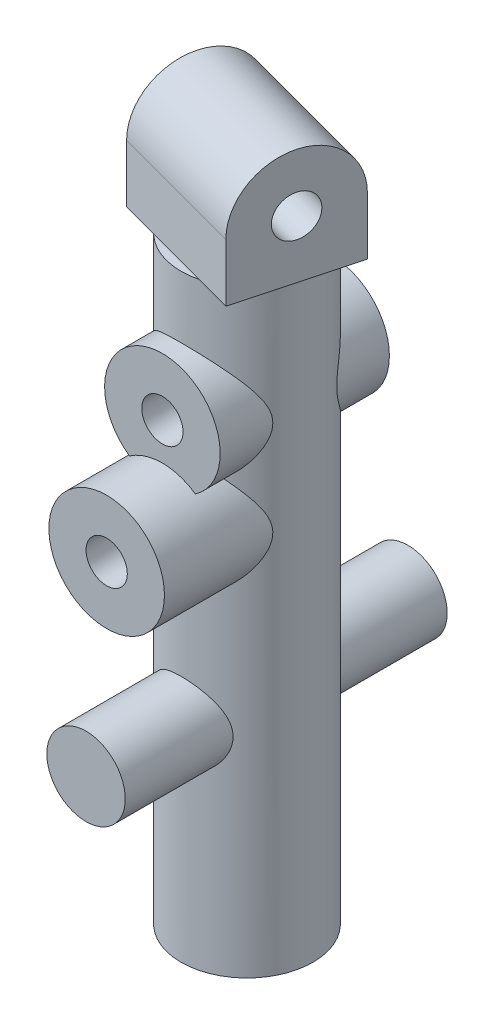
ISO-10303-21;
HEADER;
FILE_DESCRIPTION(('STEP AP214'),'2;1');
FILE_NAME('part.step','',(''),(''),'','','');
FILE_SCHEMA(('AUTOMOTIVE_DESIGN { 1 0 10303 214 1 1 1 1 }'));
ENDSEC;
DATA;
#1=APPLICATION_CONTEXT('core data for automotive mechanical design processes');
#2=APPLICATION_PROTOCOL_DEFINITION('international standard','automotive_design',2000,#1);
#3=PRODUCT_CONTEXT('',#1,'mechanical');
#4=PRODUCT('Part','Part','',(#3));
#5=PRODUCT_RELATED_PRODUCT_CATEGORY('part','',(#4));
#6=PRODUCT_DEFINITION_FORMATION('','',#4);
#7=PRODUCT_DEFINITION_CONTEXT('part definition',#1,'design');
#8=PRODUCT_DEFINITION('design','',#6,#7);
#9=PRODUCT_DEFINITION_SHAPE('','',#8);
#10=(LENGTH_UNIT() NAMED_UNIT(*) SI_UNIT(.MILLI.,.METRE.));
#11=(NAMED_UNIT(*) PLANE_ANGLE_UNIT() SI_UNIT($,.RADIAN.));
#12=(NAMED_UNIT(*) SI_UNIT($,.STERADIAN.) SOLID_ANGLE_UNIT());
#13=UNCERTAINTY_MEASURE_WITH_UNIT(LENGTH_MEASURE(1.E-05),#10,'distance_accuracy_value','');
#14=(GEOMETRIC_REPRESENTATION_CONTEXT(3) GLOBAL_UNCERTAINTY_ASSIGNED_CONTEXT((#13)) GLOBAL_UNIT_ASSIGNED_CONTEXT((#10,
#11,#12)) REPRESENTATION_CONTEXT('',''));
#15=CARTESIAN_POINT('',(0.,0.,0.));
#16=DIRECTION('',(0.,0.,1.));
#17=DIRECTION('',(1.,0.,0.));
#18=AXIS2_PLACEMENT_3D('',#15,#16,#17);
#19=CARTESIAN_POINT('',(1.64207390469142,15.9,0.439992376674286));
#20=DIRECTION('',(0.965925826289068,0.,0.258819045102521));
#21=DIRECTION('',(0.258819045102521,0.,-0.965925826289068));
#22=AXIS2_PLACEMENT_3D('',#19,#20,#21);
#23=PLANE('',#22);
#24=DIRECTION('',(0.258819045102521,0.,-0.965925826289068));
#25=VECTOR('',#24,1.);
#26=CARTESIAN_POINT('',(1.27972724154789,14.5,1.79228853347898));
#27=LINE('',#26,#25);
#28=CARTESIAN_POINT('',(1.27972724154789,14.5,1.79228853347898));
#29=VERTEX_POINT('',#28);
#30=CARTESIAN_POINT('',(2.00442056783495,14.5,-0.912303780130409));
#31=VERTEX_POINT('',#30);
#32=EDGE_CURVE('E92',#29,#31,#27,.T.);
#33=ORIENTED_EDGE('',*,*,#32,.T.);
#34=DIRECTION('',(0.,1.,0.));
#35=VECTOR('',#34,1.);
#36=CARTESIAN_POINT('',(2.00442056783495,14.5,-0.912303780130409));
#37=LINE('',#36,#35);
#38=CARTESIAN_POINT('',(2.00442056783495,15.9,-0.912303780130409));
#39=VERTEX_POINT('',#38);
#40=EDGE_CURVE('E87',#31,#39,#37,.T.);
#41=ORIENTED_EDGE('',*,*,#40,.T.);
#42=CARTESIAN_POINT('',(1.64207390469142,15.9,0.439992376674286));
#43=DIRECTION('',(0.965925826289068,0.,0.258819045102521));
#44=DIRECTION('',(0.258819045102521,0.,-0.965925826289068));
#45=AXIS2_PLACEMENT_3D('',#42,#43,#44);
#46=CIRCLE('',#45,1.4);
#47=CARTESIAN_POINT('',(1.27972724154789,15.9,1.79228853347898));
#48=VERTEX_POINT('',#47);
#49=EDGE_CURVE('E90',#39,#48,#46,.T.);
#50=ORIENTED_EDGE('',*,*,#49,.T.);
#51=DIRECTION('',(0.,-1.,0.));
#52=VECTOR('',#51,1.);
#53=CARTESIAN_POINT('',(1.27972724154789,15.9,1.79228853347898));
#54=LINE('',#53,#52);
#55=EDGE_CURVE('E57',#48,#29,#54,.T.);
#56=ORIENTED_EDGE('',*,*,#55,.T.);
#57=EDGE_LOOP('',(#33,#41,#50,#56));
#58=FACE_BOUND('',#57,.T.);
#59=CARTESIAN_POINT('',(1.64207390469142,15.9,0.439992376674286));
#60=DIRECTION('',(0.965925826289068,0.,0.258819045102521));
#61=DIRECTION('',(0.258819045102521,0.,-0.965925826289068));
#62=AXIS2_PLACEMENT_3D('',#59,#60,#61);
#63=CIRCLE('',#62,0.500000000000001);
#64=CARTESIAN_POINT('',(1.77148342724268,15.9,-0.0429705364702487));
#65=VERTEX_POINT('',#64);
#66=EDGE_CURVE('E107',#65,#65,#63,.T.);
#67=ORIENTED_EDGE('',*,*,#66,.F.);
#68=EDGE_LOOP('',(#67));
#69=FACE_BOUND('',#68,.T.);
#70=ADVANCED_FACE('F40',(#58,#69),#23,.T.);
#71=CARTESIAN_POINT('',(-1.64207390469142,15.9,-0.439992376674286));
#72=DIRECTION('',(0.965925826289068,0.,0.258819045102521));
#73=DIRECTION('',(0.258819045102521,0.,-0.965925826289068));
#74=AXIS2_PLACEMENT_3D('',#71,#72,#73);
#75=PLANE('',#74);
#76=DIRECTION('',(0.258819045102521,0.,-0.965925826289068));
#77=VECTOR('',#76,1.);
#78=CARTESIAN_POINT('',(-2.00442056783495,14.5,0.912303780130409));
#79=LINE('',#78,#77);
#80=CARTESIAN_POINT('',(-2.00442056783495,14.5,0.912303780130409));
#81=VERTEX_POINT('',#80);
#82=CARTESIAN_POINT('',(-1.27972724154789,14.5,-1.79228853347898));
#83=VERTEX_POINT('',#82);
#84=EDGE_CURVE('E104',#81,#83,#79,.T.);
#85=ORIENTED_EDGE('',*,*,#84,.F.);
#86=DIRECTION('',(0.,-1.,0.));
#87=VECTOR('',#86,1.);
#88=CARTESIAN_POINT('',(-2.00442056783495,15.9,0.912303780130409));
#89=LINE('',#88,#87);
#90=CARTESIAN_POINT('',(-2.00442056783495,15.9,0.912303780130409));
#91=VERTEX_POINT('',#90);
#92=EDGE_CURVE('E80',#91,#81,#89,.T.);
#93=ORIENTED_EDGE('',*,*,#92,.F.);
#94=CARTESIAN_POINT('',(-1.64207390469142,15.9,-0.439992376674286));
#95=DIRECTION('',(0.965925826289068,0.,0.258819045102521));
#96=DIRECTION('',(0.258819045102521,0.,-0.965925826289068));
#97=AXIS2_PLACEMENT_3D('',#94,#95,#96);
#98=CIRCLE('',#97,1.4);
#99=CARTESIAN_POINT('',(-1.27972724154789,15.9,-1.79228853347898));
#100=VERTEX_POINT('',#99);
#101=EDGE_CURVE('E74',#100,#91,#98,.T.);
#102=ORIENTED_EDGE('',*,*,#101,.F.);
#103=DIRECTION('',(0.,1.,0.));
#104=VECTOR('',#103,1.);
#105=CARTESIAN_POINT('',(-1.27972724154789,14.5,-1.79228853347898));
#106=LINE('',#105,#104);
#107=EDGE_CURVE('E96',#83,#100,#106,.T.);
#108=ORIENTED_EDGE('',*,*,#107,.F.);
#109=EDGE_LOOP('',(#85,#93,#102,#108));
#110=FACE_BOUND('',#109,.T.);
#111=CARTESIAN_POINT('',(-1.64207390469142,15.9,-0.439992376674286));
#112=DIRECTION('',(0.965925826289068,0.,0.258819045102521));
#113=DIRECTION('',(0.258819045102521,0.,-0.965925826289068));
#114=AXIS2_PLACEMENT_3D('',#111,#112,#113);
#115=CIRCLE('',#114,0.500000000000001);
#116=CARTESIAN_POINT('',(-1.51266438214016,15.9,-0.922955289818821));
#117=VERTEX_POINT('',#116);
#118=EDGE_CURVE('E119',#117,#117,#115,.T.);
#119=ORIENTED_EDGE('',*,*,#118,.T.);
#120=EDGE_LOOP('',(#119));
#121=FACE_BOUND('',#120,.T.);
#122=ADVANCED_FACE('F115',(#110,#121),#75,.F.);
#123=CARTESIAN_POINT('',(1.27972724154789,14.5,1.79228853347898));
#124=DIRECTION('',(0.,1.,0.));
#125=DIRECTION('',(-0.258819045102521,0.,0.965925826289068));
#126=AXIS2_PLACEMENT_3D('',#123,#124,#125);
#127=PLANE('',#126);
#128=ORIENTED_EDGE('',*,*,#84,.T.);
#129=DIRECTION('',(-0.965925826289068,0.,-0.258819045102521));
#130=VECTOR('',#129,1.);
#131=CARTESIAN_POINT('',(2.00442056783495,14.5,-0.912303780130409));
#132=LINE('',#131,#130);
#133=EDGE_CURVE('E12',#31,#83,#132,.T.);
#134=ORIENTED_EDGE('',*,*,#133,.F.);
#135=ORIENTED_EDGE('',*,*,#32,.F.);
#136=DIRECTION('',(-0.965925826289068,0.,-0.258819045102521));
#137=VECTOR('',#136,1.);
#138=CARTESIAN_POINT('',(1.27972724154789,14.5,1.79228853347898));
#139=LINE('',#138,#137);
#140=EDGE_CURVE('E100',#29,#81,#139,.T.);
#141=ORIENTED_EDGE('',*,*,#140,.T.);
#142=EDGE_LOOP('',(#128,#134,#135,#141));
#143=FACE_BOUND('',#142,.T.);
#144=ADVANCED_FACE('F42',(#143),#127,.F.);
#145=CARTESIAN_POINT('',(2.00442056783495,14.5,-0.912303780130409));
#146=DIRECTION('',(-0.258819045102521,0.,0.965925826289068));
#147=DIRECTION('',(0.,-1.,0.));
#148=AXIS2_PLACEMENT_3D('',#145,#146,#147);
#149=PLANE('',#148);
#150=ORIENTED_EDGE('',*,*,#107,.T.);
#151=DIRECTION('',(-0.965925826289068,0.,-0.258819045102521));
#152=VECTOR('',#151,1.);
#153=CARTESIAN_POINT('',(2.00442056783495,15.9,-0.912303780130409));
#154=LINE('',#153,#152);
#155=EDGE_CURVE('E49',#39,#100,#154,.T.);
#156=ORIENTED_EDGE('',*,*,#155,.F.);
#157=ORIENTED_EDGE('',*,*,#40,.F.);
#158=ORIENTED_EDGE('',*,*,#133,.T.);
#159=EDGE_LOOP('',(#150,#156,#157,#158));
#160=FACE_BOUND('',#159,.T.);
#161=ADVANCED_FACE('F95',(#160),#149,.F.);
#162=CARTESIAN_POINT('',(1.64207390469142,15.9,0.439992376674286));
#163=DIRECTION('',(-0.965925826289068,0.,-0.258819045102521));
#164=DIRECTION('',(-0.258819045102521,0.,0.965925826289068));
#165=AXIS2_PLACEMENT_3D('',#162,#163,#164);
#166=CYLINDRICAL_SURFACE('',#165,1.4);
#167=ORIENTED_EDGE('',*,*,#101,.T.);
#168=DIRECTION('',(-0.965925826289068,0.,-0.258819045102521));
#169=VECTOR('',#168,1.);
#170=CARTESIAN_POINT('',(1.27972724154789,15.9,1.79228853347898));
#171=LINE('',#170,#169);
#172=EDGE_CURVE('E97',#48,#91,#171,.T.);
#173=ORIENTED_EDGE('',*,*,#172,.F.);
#174=ORIENTED_EDGE('',*,*,#49,.F.);
#175=ORIENTED_EDGE('',*,*,#155,.T.);
#176=EDGE_LOOP('',(#167,#173,#174,#175));
#177=FACE_BOUND('',#176,.T.);
#178=ADVANCED_FACE('F98',(#177),#166,.T.);
#179=CARTESIAN_POINT('',(1.27972724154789,15.9,1.79228853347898));
#180=DIRECTION('',(0.258819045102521,0.,-0.965925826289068));
#181=DIRECTION('',(0.,1.,0.));
#182=AXIS2_PLACEMENT_3D('',#179,#180,#181);
#183=PLANE('',#182);
#184=ORIENTED_EDGE('',*,*,#92,.T.);
#185=ORIENTED_EDGE('',*,*,#140,.F.);
#186=ORIENTED_EDGE('',*,*,#55,.F.);
#187=ORIENTED_EDGE('',*,*,#172,.T.);
#188=EDGE_LOOP('',(#184,#185,#186,#187));
#189=FACE_BOUND('',#188,.T.);
#190=ADVANCED_FACE('F112',(#189),#183,.F.);
#191=CARTESIAN_POINT('',(1.64207390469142,15.9,0.439992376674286));
#192=DIRECTION('',(-0.965925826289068,0.,-0.258819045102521));
#193=DIRECTION('',(-0.258819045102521,0.,0.965925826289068));
#194=AXIS2_PLACEMENT_3D('',#191,#192,#193);
#195=CYLINDRICAL_SURFACE('',#194,0.500000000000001);
#196=ORIENTED_EDGE('',*,*,#66,.T.);
#197=EDGE_LOOP('',(#196));
#198=FACE_BOUND('',#197,.T.);
#199=ORIENTED_EDGE('',*,*,#118,.F.);
#200=EDGE_LOOP('',(#199));
#201=FACE_BOUND('',#200,.T.);
#202=ADVANCED_FACE('F125',(#198,#201),#195,.F.);
#203=CLOSED_SHELL('',(#70,#122,#144,#161,#178,#190,#202));
#204=MANIFOLD_SOLID_BREP('B2',#203);
#205=CARTESIAN_POINT('',(0.,14.5,0.));
#206=DIRECTION('',(0.,-1.,0.));
#207=DIRECTION('',(0.,0.,-1.));
#208=AXIS2_PLACEMENT_3D('',#205,#206,#207);
#209=CYLINDRICAL_SURFACE('',#208,1.6);
#210=CARTESIAN_POINT('',(-1.4,11.6,0.774596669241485));
#211=CARTESIAN_POINT('',(-1.39999836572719,11.5549529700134,0.774601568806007));
#212=CARTESIAN_POINT('',(-1.39779929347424,11.5098961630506,0.778613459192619));
#213=CARTESIAN_POINT('',(-1.38927241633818,11.4213448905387,0.793719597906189));
#214=CARTESIAN_POINT('',(-1.38293167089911,11.3778557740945,0.804836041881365));
#215=CARTESIAN_POINT('',(-1.36306015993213,11.274513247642,0.838201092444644));
#216=CARTESIAN_POINT('',(-1.34758750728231,11.2159603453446,0.86320052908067));
#217=CARTESIAN_POINT('',(-1.31038688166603,11.1036009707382,0.918700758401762));
#218=CARTESIAN_POINT('',(-1.28863545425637,11.0498133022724,0.949222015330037));
#219=CARTESIAN_POINT('',(-1.24445277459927,10.9570372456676,1.00616243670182));
#220=CARTESIAN_POINT('',(-1.2230697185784,10.9172714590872,1.03214449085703));
#221=CARTESIAN_POINT('',(-1.17676178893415,10.8402276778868,1.08464759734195));
#222=CARTESIAN_POINT('',(-1.15183499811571,10.8029510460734,1.11116893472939));
#223=CARTESIAN_POINT('',(-1.07180362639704,10.6948624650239,1.19031182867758));
#224=CARTESIAN_POINT('',(-1.01136219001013,10.6276125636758,1.24262997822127));
#225=CARTESIAN_POINT('',(-0.891751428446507,10.518461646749,1.33001830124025));
#226=CARTESIAN_POINT('',(-0.835507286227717,10.4742922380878,1.36628261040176));
#227=CARTESIAN_POINT('',(-0.714602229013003,10.3939357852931,1.43321030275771));
#228=CARTESIAN_POINT('',(-0.649955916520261,10.3577351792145,1.4638831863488));
#229=CARTESIAN_POINT('',(-0.525845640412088,10.3010664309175,1.51230203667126));
#230=CARTESIAN_POINT('',(-0.467676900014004,10.2789217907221,1.53139301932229));
#231=CARTESIAN_POINT('',(-0.347272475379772,10.2422990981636,1.56309523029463));
#232=CARTESIAN_POINT('',(-0.285039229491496,10.227816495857,1.57571030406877));
#233=CARTESIAN_POINT('',(-0.157774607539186,10.2074202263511,1.59350347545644));
#234=CARTESIAN_POINT('',(-0.0927303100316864,10.2015517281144,1.59864236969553));
#235=CARTESIAN_POINT('',(0.0376756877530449,10.198989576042,1.60088399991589));
#236=CARTESIAN_POINT('',(0.103037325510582,10.2022941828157,1.59798825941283));
#237=CARTESIAN_POINT('',(0.226340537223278,10.2171412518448,1.58501960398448));
#238=CARTESIAN_POINT('',(0.284440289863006,10.2279589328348,1.57557827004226));
#239=CARTESIAN_POINT('',(0.397640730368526,10.2563891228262,1.55088386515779));
#240=CARTESIAN_POINT('',(0.452740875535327,10.2740028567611,1.53562974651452));
#241=CARTESIAN_POINT('',(0.562596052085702,10.3165707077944,1.49902109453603));
#242=CARTESIAN_POINT('',(0.617071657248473,10.3419432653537,1.47732166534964));
#243=CARTESIAN_POINT('',(0.720872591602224,10.398401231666,1.42955039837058));
#244=CARTESIAN_POINT('',(0.770194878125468,10.4294899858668,1.40347600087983));
#245=CARTESIAN_POINT('',(0.887553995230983,10.5137973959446,1.33379451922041));
#246=CARTESIAN_POINT('',(0.95209958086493,10.5701526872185,1.28808757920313));
#247=CARTESIAN_POINT('',(1.06892282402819,10.6919441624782,1.19293407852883));
#248=CARTESIAN_POINT('',(1.12116427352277,10.7574062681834,1.14347703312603));
#249=CARTESIAN_POINT('',(1.20694044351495,10.8869381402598,1.0519769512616));
#250=CARTESIAN_POINT('',(1.24207099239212,10.9499163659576,1.00986660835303));
#251=CARTESIAN_POINT('',(1.30297265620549,11.0827135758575,0.929915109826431));
#252=CARTESIAN_POINT('',(1.32877600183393,11.1525079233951,0.892059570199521));
#253=CARTESIAN_POINT('',(1.36011205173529,11.2657095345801,0.842924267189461));
#254=CARTESIAN_POINT('',(1.3694830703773,11.3062116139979,0.827490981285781));
#255=CARTESIAN_POINT('',(1.38471493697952,11.3894141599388,0.801739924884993));
#256=CARTESIAN_POINT('',(1.3905847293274,11.4321087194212,0.791409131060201));
#257=CARTESIAN_POINT('',(1.39838293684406,11.5195781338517,0.777558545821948));
#258=CARTESIAN_POINT('',(1.40026057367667,11.5643724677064,0.774126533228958));
#259=CARTESIAN_POINT('',(1.39968018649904,11.6538412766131,0.77517386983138));
#260=CARTESIAN_POINT('',(1.39722111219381,11.6985157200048,0.779655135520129));
#261=CARTESIAN_POINT('',(1.38770400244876,11.791700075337,0.796476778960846));
#262=CARTESIAN_POINT('',(1.3801015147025,11.8399764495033,0.809743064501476));
#263=CARTESIAN_POINT('',(1.36051807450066,11.9336125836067,0.842226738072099));
#264=CARTESIAN_POINT('',(1.34852042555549,11.9789604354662,0.861466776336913));
#265=CARTESIAN_POINT('',(1.32252276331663,12.0610181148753,0.900786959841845));
#266=CARTESIAN_POINT('',(1.30898085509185,12.0980875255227,0.920438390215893));
#267=CARTESIAN_POINT('',(1.27921452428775,12.1702030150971,0.961381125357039));
#268=CARTESIAN_POINT('',(1.26298813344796,12.2052475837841,0.982673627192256));
#269=CARTESIAN_POINT('',(1.2104182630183,12.3076695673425,1.04784969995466));
#270=CARTESIAN_POINT('',(1.17020061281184,12.3722847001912,1.093005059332));
#271=CARTESIAN_POINT('',(1.0761864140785,12.4991750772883,1.18597999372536));
#272=CARTESIAN_POINT('',(1.02158978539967,12.5608986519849,1.23374101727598));
#273=CARTESIAN_POINT('',(0.900449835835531,12.6752162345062,1.32472801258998));
#274=CARTESIAN_POINT('',(0.833934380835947,12.7278309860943,1.36796419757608));
#275=CARTESIAN_POINT('',(0.707759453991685,12.80961962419,1.4362516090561));
#276=CARTESIAN_POINT('',(0.650740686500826,12.8413414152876,1.46311926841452));
#277=CARTESIAN_POINT('',(0.530707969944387,12.8971973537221,1.51079718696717));
#278=CARTESIAN_POINT('',(0.467697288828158,12.9213356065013,1.53161072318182));
#279=CARTESIAN_POINT('',(0.336327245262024,12.9607428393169,1.56573407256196));
#280=CARTESIAN_POINT('',(0.267926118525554,12.9759328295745,1.57897702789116));
#281=CARTESIAN_POINT('',(0.128496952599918,12.9958623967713,1.59637315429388));
#282=CARTESIAN_POINT('',(0.0574714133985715,13.0006116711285,1.60053476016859));
#283=CARTESIAN_POINT('',(-0.0748130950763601,12.9993502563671,1.5994318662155));
#284=CARTESIAN_POINT('',(-0.136102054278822,12.9946995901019,1.59535877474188));
#285=CARTESIAN_POINT('',(-0.256722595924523,12.977607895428,1.58043857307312));
#286=CARTESIAN_POINT('',(-0.316054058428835,12.9651663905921,1.56959104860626));
#287=CARTESIAN_POINT('',(-0.430799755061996,12.9333905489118,1.54203385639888));
#288=CARTESIAN_POINT('',(-0.486242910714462,12.9141154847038,1.52537461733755));
#289=CARTESIAN_POINT('',(-0.592859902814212,12.8695905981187,1.48718859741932));
#290=CARTESIAN_POINT('',(-0.644031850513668,12.8443381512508,1.46565967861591));
#291=CARTESIAN_POINT('',(-0.763791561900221,12.7761334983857,1.40812420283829));
#292=CARTESIAN_POINT('',(-0.829744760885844,12.7303494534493,1.36998120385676));
#293=CARTESIAN_POINT('',(-0.951261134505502,12.6302102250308,1.28859324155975));
#294=CARTESIAN_POINT('',(-1.00679850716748,12.5758343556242,1.24533603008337));
#295=CARTESIAN_POINT('',(-1.1085474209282,12.4586449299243,1.15577065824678));
#296=CARTESIAN_POINT('',(-1.15454601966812,12.3956820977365,1.109418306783));
#297=CARTESIAN_POINT('',(-1.23586602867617,12.2623748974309,1.01800510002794));
#298=CARTESIAN_POINT('',(-1.27120218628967,12.192040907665,0.972942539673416));
#299=CARTESIAN_POINT('',(-1.31811816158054,12.0740582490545,0.907444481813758));
#300=CARTESIAN_POINT('',(-1.33344951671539,12.029244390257,0.884598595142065));
#301=CARTESIAN_POINT('',(-1.359844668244,11.9363706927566,0.843454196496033));
#302=CARTESIAN_POINT('',(-1.37091706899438,11.8883176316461,0.82514654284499));
#303=CARTESIAN_POINT('',(-1.38614702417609,11.8002814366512,0.799233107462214));
#304=CARTESIAN_POINT('',(-1.39130096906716,11.7609229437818,0.79014484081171));
#305=CARTESIAN_POINT('',(-1.39822446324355,11.6810437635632,0.777830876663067));
#306=CARTESIAN_POINT('',(-1.40000147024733,11.6405258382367,0.774592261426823));
#307=CARTESIAN_POINT('',(-1.4,11.6,0.774596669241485));
#308=B_SPLINE_CURVE_WITH_KNOTS('',3,(#210,#211,#212,#213,#214,#215,#216,#217,#218,#219,#220,
#221,#222,#223,#224,#225,#226,#227,#228,#229,#230,#231,#232,#233,#234,#235,#236,#237,#238,#239,
#240,#241,#242,#243,#244,#245,#246,#247,#248,#249,#250,#251,#252,#253,#254,#255,#256,#257,#258,
#259,#260,#261,#262,#263,#264,#265,#266,#267,#268,#269,#270,#271,#272,#273,#274,#275,#276,#277,
#278,#279,#280,#281,#282,#283,#284,#285,#286,#287,#288,#289,#290,#291,#292,#293,#294,#295,#296,
#297,#298,#299,#300,#301,#302,#303,#304,#305,#306,#307),.UNSPECIFIED.,.T.,.F.,(4,2,2,2,2,2,2,2,
2,2,2,2,2,2,2,2,2,2,2,2,2,2,2,2,2,2,2,2,2,2,2,2,2,2,2,2,2,2,2,2,2,2,2,2,2,2,2,2,4),(0.,
0.134961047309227,0.270345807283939,0.465798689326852,0.661991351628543,0.81807241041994,
0.974238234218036,1.28588463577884,1.52561296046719,1.76493008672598,1.95944825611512,
2.15385078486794,2.34926908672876,2.54465033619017,2.72340890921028,2.90219971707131,
3.09317508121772,3.28426257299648,3.57404372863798,3.86466727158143,4.11454503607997,
4.36355088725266,4.49622883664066,4.62856637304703,4.76257735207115,4.89662079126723,
5.04768932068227,5.19933778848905,5.33141922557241,5.46359793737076,5.72813214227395,
6.01278445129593,6.29677973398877,6.50769051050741,6.71848691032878,6.93111724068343,
7.14354999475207,7.3274391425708,7.51133953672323,7.69368235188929,7.87610537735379,
8.14131068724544,8.40716452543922,8.67843221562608,8.9493229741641,9.10676990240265,
9.26389704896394,9.38558163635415,9.50699717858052),.UNSPECIFIED.);
#309=CARTESIAN_POINT('',(0.798435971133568,10.45,1.3865424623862));
#310=VERTEX_POINT('',#309);
#311=CARTESIAN_POINT('',(-0.798435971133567,10.45,1.38654246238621));
#312=VERTEX_POINT('',#311);
#313=EDGE_CURVE('E224',#310,#312,#308,.T.);
#314=ORIENTED_EDGE('',*,*,#313,.F.);
#315=CARTESIAN_POINT('',(-1.4,9.3,0.774596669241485));
#316=CARTESIAN_POINT('',(-1.39999836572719,9.25495297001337,0.774601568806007));
#317=CARTESIAN_POINT('',(-1.39779929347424,9.20989616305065,0.778613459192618));
#318=CARTESIAN_POINT('',(-1.38927241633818,9.12134489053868,0.793719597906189));
#319=CARTESIAN_POINT('',(-1.38293167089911,9.07785577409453,0.804836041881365));
#320=CARTESIAN_POINT('',(-1.36306015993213,8.97451324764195,0.838201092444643));
#321=CARTESIAN_POINT('',(-1.34758750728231,8.9159603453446,0.86320052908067));
#322=CARTESIAN_POINT('',(-1.31038688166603,8.8036009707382,0.918700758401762));
#323=CARTESIAN_POINT('',(-1.28863545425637,8.74981330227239,0.949222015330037));
#324=CARTESIAN_POINT('',(-1.24445277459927,8.65703724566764,1.00616243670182));
#325=CARTESIAN_POINT('',(-1.2230697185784,8.61727145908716,1.03214449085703));
#326=CARTESIAN_POINT('',(-1.17676178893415,8.54022767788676,1.08464759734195));
#327=CARTESIAN_POINT('',(-1.15183499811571,8.50295104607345,1.11116893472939));
#328=CARTESIAN_POINT('',(-1.07180362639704,8.39486246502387,1.19031182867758));
#329=CARTESIAN_POINT('',(-1.01136219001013,8.32761256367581,1.24262997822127));
#330=CARTESIAN_POINT('',(-0.891751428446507,8.21846164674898,1.33001830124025));
#331=CARTESIAN_POINT('',(-0.835507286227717,8.17429223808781,1.36628261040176));
#332=CARTESIAN_POINT('',(-0.714602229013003,8.09393578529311,1.43321030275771));
#333=CARTESIAN_POINT('',(-0.649955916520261,8.05773517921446,1.4638831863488));
#334=CARTESIAN_POINT('',(-0.525845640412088,8.00106643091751,1.51230203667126));
#335=CARTESIAN_POINT('',(-0.467676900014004,7.97892179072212,1.53139301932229));
#336=CARTESIAN_POINT('',(-0.347272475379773,7.94229909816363,1.56309523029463));
#337=CARTESIAN_POINT('',(-0.285039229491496,7.92781649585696,1.57571030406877));
#338=CARTESIAN_POINT('',(-0.157774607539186,7.90742022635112,1.59350347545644));
#339=CARTESIAN_POINT('',(-0.0927303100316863,7.90155172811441,1.59864236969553));
#340=CARTESIAN_POINT('',(0.0376756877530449,7.89898957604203,1.60088399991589));
#341=CARTESIAN_POINT('',(0.103037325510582,7.9022941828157,1.59798825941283));
#342=CARTESIAN_POINT('',(0.226340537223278,7.91714125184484,1.58501960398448));
#343=CARTESIAN_POINT('',(0.284440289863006,7.92795893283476,1.57557827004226));
#344=CARTESIAN_POINT('',(0.397640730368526,7.95638912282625,1.55088386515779));
#345=CARTESIAN_POINT('',(0.452740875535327,7.97400285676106,1.53562974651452));
#346=CARTESIAN_POINT('',(0.562596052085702,8.01657070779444,1.49902109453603));
#347=CARTESIAN_POINT('',(0.617071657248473,8.04194326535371,1.47732166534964));
#348=CARTESIAN_POINT('',(0.720872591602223,8.09840123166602,1.42955039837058));
#349=CARTESIAN_POINT('',(0.770194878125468,8.12948998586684,1.40347600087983));
#350=CARTESIAN_POINT('',(0.887553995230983,8.21379739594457,1.33379451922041));
#351=CARTESIAN_POINT('',(0.95209958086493,8.27015268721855,1.28808757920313));
#352=CARTESIAN_POINT('',(1.06892282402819,8.39194416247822,1.19293407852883));
#353=CARTESIAN_POINT('',(1.12116427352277,8.45740626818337,1.14347703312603));
#354=CARTESIAN_POINT('',(1.20694044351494,8.58693814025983,1.0519769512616));
#355=CARTESIAN_POINT('',(1.24207099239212,8.64991636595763,1.00986660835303));
#356=CARTESIAN_POINT('',(1.30297265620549,8.78271357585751,0.929915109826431));
#357=CARTESIAN_POINT('',(1.32877600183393,8.8525079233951,0.892059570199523));
#358=CARTESIAN_POINT('',(1.36011205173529,8.96570953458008,0.842924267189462));
#359=CARTESIAN_POINT('',(1.3694830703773,9.00621161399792,0.827490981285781));
#360=CARTESIAN_POINT('',(1.38471493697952,9.08941415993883,0.801739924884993));
#361=CARTESIAN_POINT('',(1.3905847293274,9.13210871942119,0.791409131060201));
#362=CARTESIAN_POINT('',(1.39838293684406,9.21957813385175,0.777558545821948));
#363=CARTESIAN_POINT('',(1.40026057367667,9.26437246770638,0.774126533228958));
#364=CARTESIAN_POINT('',(1.39968018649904,9.35384127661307,0.77517386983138));
#365=CARTESIAN_POINT('',(1.39722111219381,9.39851572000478,0.779655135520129));
#366=CARTESIAN_POINT('',(1.38770400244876,9.49170007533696,0.796476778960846));
#367=CARTESIAN_POINT('',(1.3801015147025,9.53997644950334,0.809743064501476));
#368=CARTESIAN_POINT('',(1.36051807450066,9.63361258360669,0.8422267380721));
#369=CARTESIAN_POINT('',(1.34852042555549,9.67896043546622,0.861466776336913));
#370=CARTESIAN_POINT('',(1.32252276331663,9.76101811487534,0.900786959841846));
#371=CARTESIAN_POINT('',(1.30898085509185,9.79808752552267,0.920438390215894));
#372=CARTESIAN_POINT('',(1.27921452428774,9.87020301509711,0.96138112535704));
#373=CARTESIAN_POINT('',(1.26298813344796,9.9052475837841,0.982673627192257));
#374=CARTESIAN_POINT('',(1.2104182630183,10.0076695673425,1.04784969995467));
#375=CARTESIAN_POINT('',(1.17020061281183,10.0722847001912,1.093005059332));
#376=CARTESIAN_POINT('',(1.07618641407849,10.1991750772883,1.18597999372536));
#377=CARTESIAN_POINT('',(1.02158978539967,10.2608986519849,1.23374101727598));
#378=CARTESIAN_POINT('',(0.900449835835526,10.3752162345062,1.32472801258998));
#379=CARTESIAN_POINT('',(0.833934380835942,10.4278309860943,1.36796419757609));
#380=CARTESIAN_POINT('',(0.70775945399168,10.50961962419,1.4362516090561));
#381=CARTESIAN_POINT('',(0.65074068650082,10.5413414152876,1.46311926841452));
#382=CARTESIAN_POINT('',(0.530707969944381,10.5971973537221,1.51079718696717));
#383=CARTESIAN_POINT('',(0.467697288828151,10.6213356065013,1.53161072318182));
#384=CARTESIAN_POINT('',(0.336327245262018,10.6607428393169,1.56573407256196));
#385=CARTESIAN_POINT('',(0.267926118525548,10.6759328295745,1.57897702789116));
#386=CARTESIAN_POINT('',(0.128496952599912,10.6958623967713,1.59637315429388));
#387=CARTESIAN_POINT('',(0.0574714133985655,10.7006116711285,1.60053476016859));
#388=CARTESIAN_POINT('',(-0.074813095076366,10.6993502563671,1.5994318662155));
#389=CARTESIAN_POINT('',(-0.136102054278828,10.6946995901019,1.59535877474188));
#390=CARTESIAN_POINT('',(-0.256722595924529,10.677607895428,1.58043857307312));
#391=CARTESIAN_POINT('',(-0.31605405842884,10.6651663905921,1.56959104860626));
#392=CARTESIAN_POINT('',(-0.430799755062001,10.6333905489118,1.54203385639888));
#393=CARTESIAN_POINT('',(-0.486242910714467,10.6141154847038,1.52537461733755));
#394=CARTESIAN_POINT('',(-0.592859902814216,10.5695905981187,1.48718859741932));
#395=CARTESIAN_POINT('',(-0.644031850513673,10.5443381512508,1.46565967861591));
#396=CARTESIAN_POINT('',(-0.763791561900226,10.4761334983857,1.40812420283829));
#397=CARTESIAN_POINT('',(-0.82974476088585,10.4303494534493,1.36998120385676));
#398=CARTESIAN_POINT('',(-0.951261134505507,10.3302102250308,1.28859324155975));
#399=CARTESIAN_POINT('',(-1.00679850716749,10.2758343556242,1.24533603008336));
#400=CARTESIAN_POINT('',(-1.10854742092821,10.1586449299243,1.15577065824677));
#401=CARTESIAN_POINT('',(-1.15454601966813,10.0956820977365,1.109418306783));
#402=CARTESIAN_POINT('',(-1.23586602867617,9.96237489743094,1.01800510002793));
#403=CARTESIAN_POINT('',(-1.27120218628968,9.89204090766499,0.972942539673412));
#404=CARTESIAN_POINT('',(-1.31811816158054,9.77405824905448,0.907444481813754));
#405=CARTESIAN_POINT('',(-1.33344951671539,9.72924439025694,0.88459859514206));
#406=CARTESIAN_POINT('',(-1.359844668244,9.6363706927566,0.843454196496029));
#407=CARTESIAN_POINT('',(-1.37091706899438,9.58831763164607,0.825146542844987));
#408=CARTESIAN_POINT('',(-1.38614702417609,9.50028143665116,0.799233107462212));
#409=CARTESIAN_POINT('',(-1.39130096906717,9.46092294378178,0.790144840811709));
#410=CARTESIAN_POINT('',(-1.39822446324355,9.38104376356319,0.777830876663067));
#411=CARTESIAN_POINT('',(-1.40000147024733,9.34052583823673,0.774592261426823));
#412=CARTESIAN_POINT('',(-1.4,9.3,0.774596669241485));
#413=B_SPLINE_CURVE_WITH_KNOTS('',3,(#315,#316,#317,#318,#319,#320,#321,#322,#323,#324,#325,
#326,#327,#328,#329,#330,#331,#332,#333,#334,#335,#336,#337,#338,#339,#340,#341,#342,#343,#344,
#345,#346,#347,#348,#349,#350,#351,#352,#353,#354,#355,#356,#357,#358,#359,#360,#361,#362,#363,
#364,#365,#366,#367,#368,#369,#370,#371,#372,#373,#374,#375,#376,#377,#378,#379,#380,#381,#382,
#383,#384,#385,#386,#387,#388,#389,#390,#391,#392,#393,#394,#395,#396,#397,#398,#399,#400,#401,
#402,#403,#404,#405,#406,#407,#408,#409,#410,#411,#412),.UNSPECIFIED.,.T.,.F.,(4,2,2,2,2,2,2,2,
2,2,2,2,2,2,2,2,2,2,2,2,2,2,2,2,2,2,2,2,2,2,2,2,2,2,2,2,2,2,2,2,2,2,2,2,2,2,2,2,4),(0.,
0.134961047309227,0.270345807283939,0.46579868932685,0.661991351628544,0.81807241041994,
0.974238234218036,1.28588463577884,1.52561296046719,1.76493008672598,1.95944825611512,
2.15385078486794,2.34926908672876,2.54465033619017,2.72340890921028,2.90219971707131,
3.09317508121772,3.28426257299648,3.57404372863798,3.86466727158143,4.11454503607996,
4.36355088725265,4.49622883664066,4.62856637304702,4.76257735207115,4.89662079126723,
5.04768932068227,5.19933778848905,5.33141922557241,5.46359793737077,5.72813214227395,
6.01278445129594,6.29677973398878,6.50769051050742,6.71848691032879,6.93111724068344,
7.14354999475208,7.3274391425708,7.51133953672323,7.69368235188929,7.87610537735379,
8.14131068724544,8.40716452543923,8.67843221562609,8.9493229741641,9.10676990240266,
9.26389704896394,9.38558163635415,9.50699717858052),.UNSPECIFIED.);
#414=EDGE_CURVE('E221',#312,#310,#413,.T.);
#415=ORIENTED_EDGE('',*,*,#414,.F.);
#416=EDGE_LOOP('',(#314,#415));
#417=FACE_BOUND('',#416,.T.);
#418=CARTESIAN_POINT('',(0.,6.,-1.6));
#419=CARTESIAN_POINT('',(0.0486831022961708,5.99999323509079,-1.59999406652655));
#420=CARTESIAN_POINT('',(0.0974373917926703,5.99623127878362,-1.59775324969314));
#421=CARTESIAN_POINT('',(0.193492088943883,5.98136295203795,-1.58899432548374));
#422=CARTESIAN_POINT('',(0.240788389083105,5.97023752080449,-1.58246511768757));
#423=CARTESIAN_POINT('',(0.33231969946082,5.9412665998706,-1.56579585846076));
#424=CARTESIAN_POINT('',(0.376568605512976,5.92345438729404,-1.55567370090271));
#425=CARTESIAN_POINT('',(0.461313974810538,5.88181766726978,-1.53268391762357));
#426=CARTESIAN_POINT('',(0.501811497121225,5.85799486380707,-1.51981707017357));
#427=CARTESIAN_POINT('',(0.581370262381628,5.8030079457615,-1.49128350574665));
#428=CARTESIAN_POINT('',(0.620091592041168,5.7714250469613,-1.47547867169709));
#429=CARTESIAN_POINT('',(0.692019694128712,5.70275251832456,-1.44314497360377));
#430=CARTESIAN_POINT('',(0.725219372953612,5.66565591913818,-1.42661521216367));
#431=CARTESIAN_POINT('',(0.789182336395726,5.5817860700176,-1.39235688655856));
#432=CARTESIAN_POINT('',(0.819180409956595,5.53438621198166,-1.37472110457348));
#433=CARTESIAN_POINT('',(0.870668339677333,5.43418228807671,-1.34270620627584));
#434=CARTESIAN_POINT('',(0.892171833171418,5.38138705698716,-1.32832188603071));
#435=CARTESIAN_POINT('',(0.921599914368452,5.28466642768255,-1.30801161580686));
#436=CARTESIAN_POINT('',(0.931535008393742,5.24160498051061,-1.30088891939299));
#437=CARTESIAN_POINT('',(0.945320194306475,5.15405455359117,-1.29090863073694));
#438=CARTESIAN_POINT('',(0.949177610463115,5.10956735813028,-1.28804590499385));
#439=CARTESIAN_POINT('',(0.950586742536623,5.02035604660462,-1.28700660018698));
#440=CARTESIAN_POINT('',(0.948126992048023,4.97563164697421,-1.28883854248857));
#441=CARTESIAN_POINT('',(0.937032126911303,4.88735548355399,-1.29692538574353));
#442=CARTESIAN_POINT('',(0.928392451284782,4.84380461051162,-1.30318355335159));
#443=CARTESIAN_POINT('',(0.905515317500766,4.75942334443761,-1.31917843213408));
#444=CARTESIAN_POINT('',(0.891338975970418,4.71856875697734,-1.3288770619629));
#445=CARTESIAN_POINT('',(0.857901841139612,4.63970584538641,-1.35070435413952));
#446=CARTESIAN_POINT('',(0.838639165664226,4.6016985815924,-1.36283391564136));
#447=CARTESIAN_POINT('',(0.791762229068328,4.52267643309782,-1.39067462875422));
#448=CARTESIAN_POINT('',(0.763281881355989,4.48226562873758,-1.40664314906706));
#449=CARTESIAN_POINT('',(0.700490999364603,4.40638431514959,-1.4389444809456));
#450=CARTESIAN_POINT('',(0.666175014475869,4.3709184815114,-1.45527762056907));
#451=CARTESIAN_POINT('',(0.587232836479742,4.30114186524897,-1.48903841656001));
#452=CARTESIAN_POINT('',(0.54184187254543,4.2676168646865,-1.50632125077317));
#453=CARTESIAN_POINT('',(0.445018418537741,4.20877395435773,-1.53770679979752));
#454=CARTESIAN_POINT('',(0.393589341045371,4.18345143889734,-1.55181129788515));
#455=CARTESIAN_POINT('',(0.289503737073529,4.14358550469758,-1.57443193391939));
#456=CARTESIAN_POINT('',(0.237142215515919,4.12845039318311,-1.58325074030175));
#457=CARTESIAN_POINT('',(0.13001703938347,4.1073623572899,-1.59561605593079));
#458=CARTESIAN_POINT('',(0.0752562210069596,4.10139887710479,-1.59916862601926));
#459=CARTESIAN_POINT('',(-0.0272290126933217,4.09919467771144,-1.60047886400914));
#460=CARTESIAN_POINT('',(-0.0749236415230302,4.10176961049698,-1.59894245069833));
#461=CARTESIAN_POINT('',(-0.169078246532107,4.11396313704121,-1.59174134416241));
#462=CARTESIAN_POINT('',(-0.215538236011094,4.12358165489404,-1.58607669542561));
#463=CARTESIAN_POINT('',(-0.305008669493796,4.14911656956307,-1.57130064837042));
#464=CARTESIAN_POINT('',(-0.348071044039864,4.16489656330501,-1.56226407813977));
#465=CARTESIAN_POINT('',(-0.430936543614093,4.20214435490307,-1.54146709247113));
#466=CARTESIAN_POINT('',(-0.470738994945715,4.22361332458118,-1.52970611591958));
#467=CARTESIAN_POINT('',(-0.550430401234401,4.2741273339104,-1.50298745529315));
#468=CARTESIAN_POINT('',(-0.589897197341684,4.30372832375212,-1.48782446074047));
#469=CARTESIAN_POINT('',(-0.663605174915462,4.36843001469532,-1.45644655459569));
#470=CARTESIAN_POINT('',(-0.697840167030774,4.40353713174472,-1.44023042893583));
#471=CARTESIAN_POINT('',(-0.764554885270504,4.48343391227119,-1.40606892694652));
#472=CARTESIAN_POINT('',(-0.796266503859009,4.52888648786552,-1.38816389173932));
#473=CARTESIAN_POINT('',(-0.851603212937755,4.62531997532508,-1.35492294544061));
#474=CARTESIAN_POINT('',(-0.875237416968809,4.67629457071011,-1.33958414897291));
#475=CARTESIAN_POINT('',(-0.909256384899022,4.77122443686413,-1.31665481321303));
#476=CARTESIAN_POINT('',(-0.921400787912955,4.81431544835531,-1.30810613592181));
#477=CARTESIAN_POINT('',(-0.939529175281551,4.90235742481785,-1.29514945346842));
#478=CARTESIAN_POINT('',(-0.945521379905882,4.94730582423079,-1.29073592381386));
#479=CARTESIAN_POINT('',(-0.951012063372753,5.03797314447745,-1.28669708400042));
#480=CARTESIAN_POINT('',(-0.950488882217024,5.08369413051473,-1.28708774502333));
#481=CARTESIAN_POINT('',(-0.942929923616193,5.17430975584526,-1.29263418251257));
#482=CARTESIAN_POINT('',(-0.935890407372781,5.2192039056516,-1.2977926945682));
#483=CARTESIAN_POINT('',(-0.916126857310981,5.30510159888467,-1.31181122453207));
#484=CARTESIAN_POINT('',(-0.903646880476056,5.34618916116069,-1.32051136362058));
#485=CARTESIAN_POINT('',(-0.873574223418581,5.4257372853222,-1.34059463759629));
#486=CARTESIAN_POINT('',(-0.855979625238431,5.46419685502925,-1.35197877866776));
#487=CARTESIAN_POINT('',(-0.813052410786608,5.54375369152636,-1.37828578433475));
#488=CARTESIAN_POINT('',(-0.786944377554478,5.58434092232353,-1.39348363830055));
#489=CARTESIAN_POINT('',(-0.729066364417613,5.66095879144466,-1.42462058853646));
#490=CARTESIAN_POINT('',(-0.697291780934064,5.69698568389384,-1.44056027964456));
#491=CARTESIAN_POINT('',(-0.623195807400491,5.76916481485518,-1.47428894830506));
#492=CARTESIAN_POINT('',(-0.580003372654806,5.80447598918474,-1.49198302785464));
#493=CARTESIAN_POINT('',(-0.487371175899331,5.86737373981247,-1.52475553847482));
#494=CARTESIAN_POINT('',(-0.437929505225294,5.89495794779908,-1.53983316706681));
#495=CARTESIAN_POINT('',(-0.335900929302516,5.94032039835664,-1.56519346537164));
#496=CARTESIAN_POINT('',(-0.283500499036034,5.95842644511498,-1.57563420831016));
#497=CARTESIAN_POINT('',(-0.175714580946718,5.98524426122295,-1.59124465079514));
#498=CARTESIAN_POINT('',(-0.120341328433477,5.99399183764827,-1.59643443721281));
#499=CARTESIAN_POINT('',(-0.0431179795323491,5.99926908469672,-1.59956668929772));
#500=CARTESIAN_POINT('',(-0.0215659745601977,6.00000299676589,-1.60000262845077));
#501=CARTESIAN_POINT('',(0.,6.,-1.6));
#502=B_SPLINE_CURVE_WITH_KNOTS('',3,(#418,#419,#420,#421,#422,#423,#424,#425,#426,#427,#428,
#429,#430,#431,#432,#433,#434,#435,#436,#437,#438,#439,#440,#441,#442,#443,#444,#445,#446,#447,
#448,#449,#450,#451,#452,#453,#454,#455,#456,#457,#458,#459,#460,#461,#462,#463,#464,#465,#466,
#467,#468,#469,#470,#471,#472,#473,#474,#475,#476,#477,#478,#479,#480,#481,#482,#483,#484,#485,
#486,#487,#488,#489,#490,#491,#492,#493,#494,#495,#496,#497,#498,#499,#500,#501),.UNSPECIFIED.,
.T.,.F.,(4,2,2,2,2,2,2,2,2,2,2,2,2,2,2,2,2,2,2,2,2,2,2,2,2,2,2,2,2,2,2,2,2,2,2,2,2,2,2,2,2,4),
(0.,0.145982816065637,0.292345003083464,0.437988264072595,0.583590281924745,0.74019735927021,
0.897004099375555,1.07254867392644,1.24781026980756,1.38152785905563,1.51508418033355,
1.64888309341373,1.78278085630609,1.91524056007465,2.04774934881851,2.2030099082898,
2.35841628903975,2.53456213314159,2.7106088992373,2.87525869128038,3.03971884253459,
3.18237229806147,3.32502421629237,3.46468244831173,3.60436946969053,3.75859505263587,
3.9130016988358,4.08691452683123,4.26063048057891,4.39679875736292,4.53278485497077,
4.66922315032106,4.80573977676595,4.9366775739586,5.06766453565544,5.21888219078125,
5.37022326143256,5.54495284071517,5.71973591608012,5.88799012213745,6.05559823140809,
6.12026670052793),.UNSPECIFIED.);
#503=CARTESIAN_POINT('',(0.,6.,-1.6));
#504=VERTEX_POINT('',#503);
#505=EDGE_CURVE('E303',#504,#504,#502,.T.);
#506=ORIENTED_EDGE('',*,*,#505,.F.);
#507=EDGE_LOOP('',(#506));
#508=FACE_BOUND('',#507,.T.);
#509=CARTESIAN_POINT('',(0.,0.,0.));
#510=DIRECTION('',(0.,1.,0.));
#511=DIRECTION('',(0.,0.,1.));
#512=AXIS2_PLACEMENT_3D('',#509,#510,#511);
#513=CIRCLE('',#512,1.6);
#514=CARTESIAN_POINT('',(0.,0.,1.6));
#515=VERTEX_POINT('',#514);
#516=EDGE_CURVE('E341',#515,#515,#513,.T.);
#517=ORIENTED_EDGE('',*,*,#516,.T.);
#518=EDGE_LOOP('',(#517));
#519=FACE_BOUND('',#518,.T.);
#520=CARTESIAN_POINT('',(0.,14.5,0.));
#521=DIRECTION('',(0.,1.,0.));
#522=DIRECTION('',(0.,0.,1.));
#523=AXIS2_PLACEMENT_3D('',#520,#521,#522);
#524=CIRCLE('',#523,1.6);
#525=CARTESIAN_POINT('',(0.,14.5,1.6));
#526=VERTEX_POINT('',#525);
#527=EDGE_CURVE('E345',#526,#526,#524,.T.);
#528=ORIENTED_EDGE('',*,*,#527,.F.);
#529=EDGE_LOOP('',(#528));
#530=FACE_BOUND('',#529,.T.);
#531=CARTESIAN_POINT('',(-0.95,5.05,1.28743931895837));
#532=CARTESIAN_POINT('',(-0.950001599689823,5.00207707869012,1.28743709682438));
#533=CARTESIAN_POINT('',(-0.946351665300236,4.95416218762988,1.29015508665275));
#534=CARTESIAN_POINT('',(-0.932014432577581,4.85993431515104,1.30054767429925));
#535=CARTESIAN_POINT('',(-0.921319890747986,4.81362303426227,1.30822737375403));
#536=CARTESIAN_POINT('',(-0.893596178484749,4.72416729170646,1.3273142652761));
#537=CARTESIAN_POINT('',(-0.876611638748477,4.68100302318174,1.33869512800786));
#538=CARTESIAN_POINT('',(-0.836931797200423,4.59816270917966,1.36385346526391));
#539=CARTESIAN_POINT('',(-0.814234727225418,4.55848774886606,1.37763168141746));
#540=CARTESIAN_POINT('',(-0.760612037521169,4.47855076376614,1.40802252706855));
#541=CARTESIAN_POINT('',(-0.729027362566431,4.43878471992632,1.42477713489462));
#542=CARTESIAN_POINT('',(-0.659878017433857,4.36470386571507,1.45809328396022));
#543=CARTESIAN_POINT('',(-0.622309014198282,4.33039304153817,1.47465467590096));
#544=CARTESIAN_POINT('',(-0.5374699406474,4.26463488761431,1.5077827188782));
#545=CARTESIAN_POINT('',(-0.489595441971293,4.2338665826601,1.52416730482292));
#546=CARTESIAN_POINT('',(-0.388191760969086,4.18105489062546,1.55308628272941));
#547=CARTESIAN_POINT('',(-0.334667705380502,4.15900367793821,1.56562412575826));
#548=CARTESIAN_POINT('',(-0.228795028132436,4.12646068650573,1.58438185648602));
#549=CARTESIAN_POINT('',(-0.176808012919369,4.11507786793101,1.59108447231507));
#550=CARTESIAN_POINT('',(-0.0712736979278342,4.1011876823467,1.59928470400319));
#551=CARTESIAN_POINT('',(-0.0177278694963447,4.09867220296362,1.60078707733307));
#552=CARTESIAN_POINT('',(0.0823895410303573,4.10241771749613,1.59856579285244));
#553=CARTESIAN_POINT('',(0.129018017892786,4.10764947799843,1.59545493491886));
#554=CARTESIAN_POINT('',(0.220593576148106,4.12479282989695,1.58538956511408));
#555=CARTESIAN_POINT('',(0.265540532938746,4.13670491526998,1.57843476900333));
#556=CARTESIAN_POINT('',(0.35293887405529,4.16677529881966,1.56122816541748));
#557=CARTESIAN_POINT('',(0.395372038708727,4.18497389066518,1.55095511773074));
#558=CARTESIAN_POINT('',(0.476638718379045,4.22695109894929,1.52794034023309));
#559=CARTESIAN_POINT('',(0.515471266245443,4.2507312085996,1.51519794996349));
#560=CARTESIAN_POINT('',(0.593349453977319,4.30636722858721,1.48655784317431));
#561=CARTESIAN_POINT('',(0.631878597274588,4.33884522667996,1.47046520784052));
#562=CARTESIAN_POINT('',(0.703266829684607,4.40934609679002,1.43769343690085));
#563=CARTESIAN_POINT('',(0.736118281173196,4.44737631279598,1.42101354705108));
#564=CARTESIAN_POINT('',(0.798940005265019,4.53296831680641,1.38676316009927));
#565=CARTESIAN_POINT('',(0.828172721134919,4.58112086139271,1.36930291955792));
#566=CARTESIAN_POINT('',(0.877962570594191,4.68275569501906,1.33792857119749));
#567=CARTESIAN_POINT('',(0.89853560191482,4.7362279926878,1.324007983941));
#568=CARTESIAN_POINT('',(0.926056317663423,4.83362032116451,1.30484830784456));
#569=CARTESIAN_POINT('',(0.935102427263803,4.87669366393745,1.29832040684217));
#570=CARTESIAN_POINT('',(0.947132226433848,4.96409075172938,1.28957308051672));
#571=CARTESIAN_POINT('',(0.950122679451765,5.00841304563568,1.28734884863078));
#572=CARTESIAN_POINT('',(0.949869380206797,5.09708034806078,1.28753564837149));
#573=CARTESIAN_POINT('',(0.94661820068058,5.1414253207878,1.28995220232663));
#574=CARTESIAN_POINT('',(0.934066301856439,5.22880755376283,1.29906803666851));
#575=CARTESIAN_POINT('',(0.92476087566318,5.27184376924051,1.30577064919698));
#576=CARTESIAN_POINT('',(0.900540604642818,5.35567355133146,1.32258900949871));
#577=CARTESIAN_POINT('',(0.885614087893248,5.39646224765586,1.33271185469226));
#578=CARTESIAN_POINT('',(0.850674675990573,5.47509548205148,1.3552802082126));
#579=CARTESIAN_POINT('',(0.830659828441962,5.5129388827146,1.36772660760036));
#580=CARTESIAN_POINT('',(0.782014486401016,5.5917195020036,1.39620212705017));
#581=CARTESIAN_POINT('',(0.752485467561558,5.63201466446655,1.41247512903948));
#582=CARTESIAN_POINT('',(0.687526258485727,5.70748774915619,1.44521033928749));
#583=CARTESIAN_POINT('',(0.652090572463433,5.74266084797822,1.46167271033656));
#584=CARTESIAN_POINT('',(0.571099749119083,5.81124517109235,1.49532418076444));
#585=CARTESIAN_POINT('',(0.524835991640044,5.84390729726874,1.51235352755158));
#586=CARTESIAN_POINT('',(0.426376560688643,5.90084030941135,1.54300155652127));
#587=CARTESIAN_POINT('',(0.374185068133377,5.9251170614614,1.55662262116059));
#588=CARTESIAN_POINT('',(0.269384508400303,5.96257342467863,1.57799629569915));
#589=CARTESIAN_POINT('',(0.217101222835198,5.97644956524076,1.58611283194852));
#590=CARTESIAN_POINT('',(0.110416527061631,5.99510918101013,1.59708244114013));
#591=CARTESIAN_POINT('',(0.0560174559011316,5.99990242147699,1.59994116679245));
#592=CARTESIAN_POINT('',(-0.0457123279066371,6.00008232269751,1.60004965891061));
#593=CARTESIAN_POINT('',(-0.0930451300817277,5.99660788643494,1.59797852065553));
#594=CARTESIAN_POINT('',(-0.186321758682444,5.98274150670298,1.58980348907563));
#595=CARTESIAN_POINT('',(-0.232265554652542,5.97234941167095,1.58369950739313));
#596=CARTESIAN_POINT('',(-0.321028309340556,5.94530461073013,1.56810412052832));
#597=CARTESIAN_POINT('',(-0.363877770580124,5.928727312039,1.55865358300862));
#598=CARTESIAN_POINT('',(-0.446205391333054,5.88992485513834,1.53711211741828));
#599=CARTESIAN_POINT('',(-0.485682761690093,5.86769837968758,1.52502057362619));
#600=CARTESIAN_POINT('',(-0.564789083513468,5.8155050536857,1.49764837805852));
#601=CARTESIAN_POINT('',(-0.603963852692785,5.78495800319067,1.48216366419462));
#602=CARTESIAN_POINT('',(-0.676940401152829,5.71835390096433,1.45028996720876));
#603=CARTESIAN_POINT('',(-0.710735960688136,5.68229056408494,1.43389996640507));
#604=CARTESIAN_POINT('',(-0.776219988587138,5.60050211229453,1.39964544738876));
#605=CARTESIAN_POINT('',(-0.807146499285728,5.55413487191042,1.38184544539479));
#606=CARTESIAN_POINT('',(-0.860732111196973,5.45590960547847,1.34912158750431));
#607=CARTESIAN_POINT('',(-0.883397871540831,5.40405604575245,1.33419541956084));
#608=CARTESIAN_POINT('',(-0.917230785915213,5.30239518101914,1.31112914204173));
#609=CARTESIAN_POINT('',(-0.929444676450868,5.25307761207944,1.30239319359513));
#610=CARTESIAN_POINT('',(-0.945821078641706,5.15250115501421,1.290554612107));
#611=CARTESIAN_POINT('',(-0.949998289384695,5.10124598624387,1.2874416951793));
#612=CARTESIAN_POINT('',(-0.95,5.05,1.28743931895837));
#613=B_SPLINE_CURVE_WITH_KNOTS('',3,(#531,#532,#533,#534,#535,#536,#537,#538,#539,#540,#541,
#542,#543,#544,#545,#546,#547,#548,#549,#550,#551,#552,#553,#554,#555,#556,#557,#558,#559,#560,
#561,#562,#563,#564,#565,#566,#567,#568,#569,#570,#571,#572,#573,#574,#575,#576,#577,#578,#579,
#580,#581,#582,#583,#584,#585,#586,#587,#588,#589,#590,#591,#592,#593,#594,#595,#596,#597,#598,
#599,#600,#601,#602,#603,#604,#605,#606,#607,#608,#609,#610,#611,#612),.UNSPECIFIED.,.T.,.F.,(4,
2,2,2,2,2,2,2,2,2,2,2,2,2,2,2,2,2,2,2,2,2,2,2,2,2,2,2,2,2,2,2,2,2,2,2,2,2,2,2,4),(0.,
0.143554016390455,0.287255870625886,0.429957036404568,0.572702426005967,0.732498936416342,
0.892411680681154,1.06911655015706,1.24566242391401,1.4056297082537,1.56545060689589,
1.70585275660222,1.84626528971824,1.98759503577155,2.12896263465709,2.28702640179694,
2.44530116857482,2.62134558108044,2.79706538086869,2.92997427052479,3.06273463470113,
3.19565307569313,3.32867497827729,3.46197463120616,3.59532550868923,3.75233204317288,
3.90948548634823,4.08597263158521,4.26233606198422,4.42545329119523,4.58839504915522,
4.73021320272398,4.87203446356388,5.01218038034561,5.15235900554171,5.3078448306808,
5.46350915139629,5.63819276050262,5.81273524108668,5.96652511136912,6.12003343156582),.UNSPECIFIED.);
#614=CARTESIAN_POINT('',(-0.95,5.05,1.28743931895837));
#615=VERTEX_POINT('',#614);
#616=EDGE_CURVE('E309',#615,#615,#613,.T.);
#617=ORIENTED_EDGE('',*,*,#616,.F.);
#618=EDGE_LOOP('',(#617));
#619=FACE_BOUND('',#618,.T.);
#620=CARTESIAN_POINT('',(0.,13.,-1.6));
#621=CARTESIAN_POINT('',(0.0654596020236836,12.9999944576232,-1.59999455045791));
#622=CARTESIAN_POINT('',(0.130978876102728,12.995370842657,-1.59594464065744));
#623=CARTESIAN_POINT('',(0.2598396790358,12.977220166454,-1.58010021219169));
#624=CARTESIAN_POINT('',(0.32317787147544,12.9636800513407,-1.56829433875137));
#625=CARTESIAN_POINT('',(0.445462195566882,12.928752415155,-1.53802061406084));
#626=CARTESIAN_POINT('',(0.504433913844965,12.9074158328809,-1.51959601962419));
#627=CARTESIAN_POINT('',(0.617359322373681,12.8580431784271,-1.47733239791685));
#628=CARTESIAN_POINT('',(0.671311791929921,12.8300054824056,-1.45349205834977));
#629=CARTESIAN_POINT('',(0.793551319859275,12.7563542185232,-1.39162061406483));
#630=CARTESIAN_POINT('',(0.859299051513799,12.7081389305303,-1.35166922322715));
#631=CARTESIAN_POINT('',(0.979965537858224,12.6030469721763,-1.26693840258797));
#632=CARTESIAN_POINT('',(1.0348550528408,12.54614762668,-1.22214642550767));
#633=CARTESIAN_POINT('',(1.13498265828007,12.4235437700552,-1.12983256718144));
#634=CARTESIAN_POINT('',(1.17998494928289,12.3576747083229,-1.08227250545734));
#635=CARTESIAN_POINT('',(1.23900927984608,12.2530311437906,-1.01281116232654));
#636=CARTESIAN_POINT('',(1.25726302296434,12.2171983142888,-0.989982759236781));
#637=CARTESIAN_POINT('',(1.29088005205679,12.1433907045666,-0.945725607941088));
#638=CARTESIAN_POINT('',(1.30624553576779,12.1054175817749,-0.924295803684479));
#639=CARTESIAN_POINT('',(1.33432478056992,12.0259201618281,-0.88329621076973));
#640=CARTESIAN_POINT('',(1.34694611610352,11.9843238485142,-0.863800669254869));
#641=CARTESIAN_POINT('',(1.36853092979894,11.8984531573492,-0.829180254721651));
#642=CARTESIAN_POINT('',(1.3775014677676,11.8541841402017,-0.814046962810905));
#643=CARTESIAN_POINT('',(1.39015395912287,11.7702391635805,-0.79221783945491));
#644=CARTESIAN_POINT('',(1.39443861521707,11.7309093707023,-0.784580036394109));
#645=CARTESIAN_POINT('',(1.39962338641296,11.6513474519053,-0.775297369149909));
#646=CARTESIAN_POINT('',(1.40052882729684,11.6111168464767,-0.773643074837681));
#647=CARTESIAN_POINT('',(1.39887228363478,11.5309744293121,-0.77663219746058));
#648=CARTESIAN_POINT('',(1.39631007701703,11.4910626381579,-0.781276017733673));
#649=CARTESIAN_POINT('',(1.3879628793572,11.4125859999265,-0.796007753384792));
#650=CARTESIAN_POINT('',(1.38217145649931,11.3740240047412,-0.806106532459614));
#651=CARTESIAN_POINT('',(1.36340054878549,11.2760912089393,-0.837638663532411));
#652=CARTESIAN_POINT('',(1.34819246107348,11.2181960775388,-0.86223469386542));
#653=CARTESIAN_POINT('',(1.31165126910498,11.1070288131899,-0.916875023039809));
#654=CARTESIAN_POINT('',(1.2902924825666,11.0537773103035,-0.946941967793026));
#655=CARTESIAN_POINT('',(1.24671932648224,10.9614449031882,-1.00334729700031));
#656=CARTESIAN_POINT('',(1.22549172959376,10.9216312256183,-1.02926268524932));
#657=CARTESIAN_POINT('',(1.1795013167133,10.8444899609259,-1.08166328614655));
#658=CARTESIAN_POINT('',(1.15473651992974,10.8071637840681,-1.10814881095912));
#659=CARTESIAN_POINT('',(1.07520319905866,10.6989141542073,-1.18722509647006));
#660=CARTESIAN_POINT('',(1.01511202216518,10.6315432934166,-1.23955090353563));
#661=CARTESIAN_POINT('',(0.895909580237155,10.5218904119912,-1.32722592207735));
#662=CARTESIAN_POINT('',(0.839676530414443,10.4773856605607,-1.36373143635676));
#663=CARTESIAN_POINT('',(0.718726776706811,10.3963772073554,-1.43115303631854));
#664=CARTESIAN_POINT('',(0.654025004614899,10.3598597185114,-1.46207873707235));
#665=CARTESIAN_POINT('',(0.529853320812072,10.3026936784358,-1.51090361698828));
#666=CARTESIAN_POINT('',(0.471702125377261,10.2803507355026,-1.53015985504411));
#667=CARTESIAN_POINT('',(0.351290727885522,10.2433303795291,-1.5621989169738));
#668=CARTESIAN_POINT('',(0.289032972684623,10.2286484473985,-1.57498555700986));
#669=CARTESIAN_POINT('',(0.161665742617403,10.2078626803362,-1.59311651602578));
#670=CARTESIAN_POINT('',(0.0965428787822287,10.2018048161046,-1.59842094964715));
#671=CARTESIAN_POINT('',(-0.034063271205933,10.1988923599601,-1.60096903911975));
#672=CARTESIAN_POINT('',(-0.0995464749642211,10.2020357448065,-1.59821446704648));
#673=CARTESIAN_POINT('',(-0.223025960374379,10.2166017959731,-1.58549043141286));
#674=CARTESIAN_POINT('',(-0.281180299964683,10.2272857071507,-1.57616486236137));
#675=CARTESIAN_POINT('',(-0.394517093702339,10.2554669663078,-1.55168312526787));
#676=CARTESIAN_POINT('',(-0.449698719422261,10.272966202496,-1.53652534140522));
#677=CARTESIAN_POINT('',(-0.559659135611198,10.3152888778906,-1.500119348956));
#678=CARTESIAN_POINT('',(-0.614165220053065,10.340523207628,-1.47853216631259));
#679=CARTESIAN_POINT('',(-0.718021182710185,10.39669799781,-1.43098315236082));
#680=CARTESIAN_POINT('',(-0.767370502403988,10.4276390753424,-1.40502084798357));
#681=CARTESIAN_POINT('',(-0.884712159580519,10.5114991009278,-1.33567210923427));
#682=CARTESIAN_POINT('',(-0.949242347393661,10.5675380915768,-1.29019076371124));
#683=CARTESIAN_POINT('',(-1.06625678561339,10.688814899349,-1.19531990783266));
#684=CARTESIAN_POINT('',(-1.11867585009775,10.7540995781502,-1.14591108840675));
#685=CARTESIAN_POINT('',(-1.1886464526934,10.8590982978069,-1.07159650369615));
#686=CARTESIAN_POINT('',(-1.2107279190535,10.895738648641,-1.04650277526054));
#687=CARTESIAN_POINT('',(-1.25168009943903,10.9713897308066,-0.99715736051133));
#688=CARTESIAN_POINT('',(-1.27054804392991,11.0104024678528,-0.972906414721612));
#689=CARTESIAN_POINT('',(-1.30480546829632,11.0907097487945,-0.926449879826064));
#690=CARTESIAN_POINT('',(-1.32021730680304,11.1319873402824,-0.90423172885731));
#691=CARTESIAN_POINT('',(-1.34741337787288,11.2172797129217,-0.863180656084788));
#692=CARTESIAN_POINT('',(-1.35920548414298,11.2612882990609,-0.844340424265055));
#693=CARTESIAN_POINT('',(-1.377333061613,11.3459224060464,-0.814382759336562));
#694=CARTESIAN_POINT('',(-1.38419756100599,11.3861743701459,-0.802557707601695));
#695=CARTESIAN_POINT('',(-1.39440335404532,11.4683158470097,-0.78469681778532));
#696=CARTESIAN_POINT('',(-1.39775570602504,11.5101997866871,-0.778642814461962));
#697=CARTESIAN_POINT('',(-1.40063375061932,11.5948450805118,-0.773457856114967));
#698=CARTESIAN_POINT('',(-1.40013308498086,11.6376104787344,-0.774374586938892));
#699=CARTESIAN_POINT('',(-1.39529913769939,11.7222604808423,-0.783045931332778));
#700=CARTESIAN_POINT('',(-1.3909574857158,11.7641429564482,-0.790815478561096));
#701=CARTESIAN_POINT('',(-1.37683330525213,11.859562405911,-0.815218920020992));
#702=CARTESIAN_POINT('',(-1.36572171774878,11.9123443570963,-0.833941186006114));
#703=CARTESIAN_POINT('',(-1.33839240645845,12.0141313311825,-0.877130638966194));
#704=CARTESIAN_POINT('',(-1.32215655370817,12.0631221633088,-0.901618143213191));
#705=CARTESIAN_POINT('',(-1.28766986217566,12.1512027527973,-0.95009011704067));
#706=CARTESIAN_POINT('',(-1.2699906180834,12.1907343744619,-0.973692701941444));
#707=CARTESIAN_POINT('',(-1.23140209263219,12.2674526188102,-1.02206142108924));
#708=CARTESIAN_POINT('',(-1.21049073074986,12.3046377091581,-1.04682829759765));
#709=CARTESIAN_POINT('',(-1.14295399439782,12.4129676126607,-1.1216760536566));
#710=CARTESIAN_POINT('',(-1.0915409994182,12.4808493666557,-1.17228146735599));
#711=CARTESIAN_POINT('',(-0.973825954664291,12.6097241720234,-1.27195034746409));
#712=CARTESIAN_POINT('',(-0.907060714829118,12.6703877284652,-1.32089556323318));
#713=CARTESIAN_POINT('',(-0.759661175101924,12.7795097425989,-1.41077765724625));
#714=CARTESIAN_POINT('',(-0.679079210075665,12.8280126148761,-1.45174355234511));
#715=CARTESIAN_POINT('',(-0.537050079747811,12.8943342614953,-1.50835234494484));
#716=CARTESIAN_POINT('',(-0.47930679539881,12.9168965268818,-1.52778588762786));
#717=CARTESIAN_POINT('',(-0.359736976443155,12.9544337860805,-1.56025647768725));
#718=CARTESIAN_POINT('',(-0.297919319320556,12.9694246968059,-1.57330694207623));
#719=CARTESIAN_POINT('',(-0.196362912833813,12.9867133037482,-1.58838424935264));
#720=CARTESIAN_POINT('',(-0.157396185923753,12.9916804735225,-1.59272468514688));
#721=CARTESIAN_POINT('',(-0.078960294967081,12.9983259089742,-1.59853456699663));
#722=CARTESIAN_POINT('',(-0.0394910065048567,13.0000033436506,-1.60000328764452));
#723=CARTESIAN_POINT('',(0.,13.,-1.6));
#724=B_SPLINE_CURVE_WITH_KNOTS('',3,(#620,#621,#622,#623,#624,#625,#626,#627,#628,#629,#630,
#631,#632,#633,#634,#635,#636,#637,#638,#639,#640,#641,#642,#643,#644,#645,#646,#647,#648,#649,
#650,#651,#652,#653,#654,#655,#656,#657,#658,#659,#660,#661,#662,#663,#664,#665,#666,#667,#668,
#669,#670,#671,#672,#673,#674,#675,#676,#677,#678,#679,#680,#681,#682,#683,#684,#685,#686,#687,
#688,#689,#690,#691,#692,#693,#694,#695,#696,#697,#698,#699,#700,#701,#702,#703,#704,#705,#706,
#707,#708,#709,#710,#711,#712,#713,#714,#715,#716,#717,#718,#719,#720,#721,#722,#723),
.UNSPECIFIED.,.T.,.F.,(4,2,2,2,2,2,2,2,2,2,2,2,2,2,2,2,2,2,2,2,2,2,2,2,2,2,2,2,2,2,2,2,2,2,2,2,
2,2,2,2,2,2,2,2,2,2,2,2,2,2,2,4),(0.,0.196207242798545,0.392702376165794,0.587936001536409,
0.783216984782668,1.05411729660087,1.325737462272,1.60326344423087,1.74187135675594,
1.8803733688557,2.02299338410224,2.16533627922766,2.28570159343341,2.40587712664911,
2.5260603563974,2.64648382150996,2.83953149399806,3.03339722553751,3.18929555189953,
3.34528152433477,3.65658096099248,3.89716553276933,4.13733148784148,4.33215200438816,
4.52685746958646,4.72259697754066,4.91829344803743,5.09708263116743,5.27592138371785,
5.46669650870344,5.65749227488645,5.94639729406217,6.23682283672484,6.38548260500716,
6.53426985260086,6.68206484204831,6.82953602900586,6.95661719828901,7.08329702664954,
7.21084423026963,7.33867007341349,7.50899622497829,7.67993185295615,7.82769318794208,
7.97555003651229,8.27140152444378,8.57774052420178,8.88294382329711,9.07711367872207,
9.27087362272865,9.38921325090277,9.50758276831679),.UNSPECIFIED.);
#725=CARTESIAN_POINT('',(0.,13.,-1.6));
#726=VERTEX_POINT('',#725);
#727=EDGE_CURVE('E38',#726,#726,#724,.T.);
#728=ORIENTED_EDGE('',*,*,#727,.F.);
#729=EDGE_LOOP('',(#728));
#730=FACE_BOUND('',#729,.T.);
#731=ADVANCED_FACE('F184',(#417,#508,#519,#530,#619,#730),#209,.T.);
#732=CARTESIAN_POINT('',(0.,9.3,3.4));
#733=DIRECTION('',(0.,0.,-1.));
#734=DIRECTION('',(-1.,0.,0.));
#735=AXIS2_PLACEMENT_3D('',#732,#733,#734);
#736=CYLINDRICAL_SURFACE('',#735,1.4);
#737=CARTESIAN_POINT('',(0.,9.3,3.4));
#738=DIRECTION('',(0.,0.,1.));
#739=DIRECTION('',(1.,0.,0.));
#740=AXIS2_PLACEMENT_3D('',#737,#738,#739);
#741=CIRCLE('',#740,1.4);
#742=CARTESIAN_POINT('',(1.4,9.3,3.4));
#743=VERTEX_POINT('',#742);
#744=EDGE_CURVE('E275',#743,#743,#741,.T.);
#745=ORIENTED_EDGE('',*,*,#744,.F.);
#746=EDGE_LOOP('',(#745));
#747=FACE_BOUND('',#746,.T.);
#748=DIRECTION('',(0.,0.,-1.));
#749=VECTOR('',#748,1.);
#750=CARTESIAN_POINT('',(0.798435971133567,10.45,0.));
#751=LINE('',#750,#749);
#752=CARTESIAN_POINT('',(0.798435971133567,10.45,2.05));
#753=VERTEX_POINT('',#752);
#754=EDGE_CURVE('E197',#753,#310,#751,.T.);
#755=ORIENTED_EDGE('',*,*,#754,.F.);
#756=CARTESIAN_POINT('',(0.,9.3,2.05));
#757=DIRECTION('',(0.,0.,1.));
#758=DIRECTION('',(1.,0.,0.));
#759=AXIS2_PLACEMENT_3D('',#756,#757,#758);
#760=CIRCLE('',#759,1.4);
#761=CARTESIAN_POINT('',(-0.798435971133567,10.45,2.05));
#762=VERTEX_POINT('',#761);
#763=EDGE_CURVE('E216',#753,#762,#760,.T.);
#764=ORIENTED_EDGE('',*,*,#763,.T.);
#765=DIRECTION('',(0.,0.,-1.));
#766=VECTOR('',#765,1.);
#767=CARTESIAN_POINT('',(-0.798435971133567,10.45,0.));
#768=LINE('',#767,#766);
#769=EDGE_CURVE('E220',#312,#762,#768,.F.);
#770=ORIENTED_EDGE('',*,*,#769,.F.);
#771=ORIENTED_EDGE('',*,*,#414,.T.);
#772=EDGE_LOOP('',(#755,#764,#770,#771));
#773=FACE_BOUND('',#772,.T.);
#774=ADVANCED_FACE('F228',(#747,#773),#736,.T.);
#775=CARTESIAN_POINT('',(0.,14.5,0.));
#776=DIRECTION('',(0.,1.,0.));
#777=DIRECTION('',(0.,0.,1.));
#778=AXIS2_PLACEMENT_3D('',#775,#776,#777);
#779=PLANE('',#778);
#780=ORIENTED_EDGE('',*,*,#527,.T.);
#781=EDGE_LOOP('',(#780));
#782=FACE_BOUND('',#781,.T.);
#783=ADVANCED_FACE('F295',(#782),#779,.T.);
#784=CARTESIAN_POINT('',(0.,0.,0.));
#785=DIRECTION('',(0.,1.,0.));
#786=DIRECTION('',(0.,0.,1.));
#787=AXIS2_PLACEMENT_3D('',#784,#785,#786);
#788=PLANE('',#787);
#789=CARTESIAN_POINT('',(0.,0.,0.));
#790=DIRECTION('',(0.,-1.,0.));
#791=DIRECTION('',(0.,0.,-1.));
#792=AXIS2_PLACEMENT_3D('',#789,#790,#791);
#793=CIRCLE('',#792,0.6);
#794=CARTESIAN_POINT('',(0.,0.,-0.6));
#795=VERTEX_POINT('',#794);
#796=EDGE_CURVE('E264',#795,#795,#793,.T.);
#797=ORIENTED_EDGE('',*,*,#796,.F.);
#798=EDGE_LOOP('',(#797));
#799=FACE_BOUND('',#798,.T.);
#800=ORIENTED_EDGE('',*,*,#516,.F.);
#801=EDGE_LOOP('',(#800));
#802=FACE_BOUND('',#801,.T.);
#803=ADVANCED_FACE('F321',(#799,#802),#788,.F.);
#804=CARTESIAN_POINT('',(0.,5.05,3.9));
#805=DIRECTION('',(0.,0.,1.));
#806=DIRECTION('',(1.,0.,0.));
#807=AXIS2_PLACEMENT_3D('',#804,#805,#806);
#808=PLANE('',#807);
#809=CARTESIAN_POINT('',(0.,5.05,3.9));
#810=DIRECTION('',(0.,0.,1.));
#811=DIRECTION('',(1.,0.,0.));
#812=AXIS2_PLACEMENT_3D('',#809,#810,#811);
#813=CIRCLE('',#812,0.95);
#814=CARTESIAN_POINT('',(0.95,5.05,3.9));
#815=VERTEX_POINT('',#814);
#816=EDGE_CURVE('E353',#815,#815,#813,.T.);
#817=ORIENTED_EDGE('',*,*,#816,.T.);
#818=EDGE_LOOP('',(#817));
#819=FACE_BOUND('',#818,.T.);
#820=ADVANCED_FACE('F297',(#819),#808,.T.);
#821=CARTESIAN_POINT('',(0.,5.05,3.9));
#822=DIRECTION('',(0.,0.,-1.));
#823=DIRECTION('',(-1.,0.,0.));
#824=AXIS2_PLACEMENT_3D('',#821,#822,#823);
#825=CYLINDRICAL_SURFACE('',#824,0.95);
#826=ORIENTED_EDGE('',*,*,#816,.F.);
#827=EDGE_LOOP('',(#826));
#828=FACE_BOUND('',#827,.T.);
#829=ORIENTED_EDGE('',*,*,#616,.T.);
#830=EDGE_LOOP('',(#829));
#831=FACE_BOUND('',#830,.T.);
#832=ADVANCED_FACE('F317',(#828,#831),#825,.T.);
#833=CARTESIAN_POINT('',(0.,5.05,-3.9));
#834=DIRECTION('',(0.,0.,1.));
#835=DIRECTION('',(1.,0.,0.));
#836=AXIS2_PLACEMENT_3D('',#833,#834,#835);
#837=CIRCLE('',#836,0.95);
#838=CARTESIAN_POINT('',(0.95,5.05,-3.9));
#839=VERTEX_POINT('',#838);
#840=EDGE_CURVE('E355',#839,#839,#837,.T.);
#841=ORIENTED_EDGE('',*,*,#840,.T.);
#842=EDGE_LOOP('',(#841));
#843=FACE_BOUND('',#842,.T.);
#844=ORIENTED_EDGE('',*,*,#505,.T.);
#845=EDGE_LOOP('',(#844));
#846=FACE_BOUND('',#845,.T.);
#847=ADVANCED_FACE('F313',(#843,#846),#825,.T.);
#848=CARTESIAN_POINT('',(0.,5.05,-3.9));
#849=DIRECTION('',(0.,0.,1.));
#850=DIRECTION('',(1.,0.,0.));
#851=AXIS2_PLACEMENT_3D('',#848,#849,#850);
#852=PLANE('',#851);
#853=ORIENTED_EDGE('',*,*,#840,.F.);
#854=EDGE_LOOP('',(#853));
#855=FACE_BOUND('',#854,.T.);
#856=ADVANCED_FACE('F290',(#855),#852,.F.);
#857=CARTESIAN_POINT('',(0.,9.3,3.4));
#858=DIRECTION('',(0.,0.,1.));
#859=DIRECTION('',(1.,0.,0.));
#860=AXIS2_PLACEMENT_3D('',#857,#858,#859);
#861=PLANE('',#860);
#862=CARTESIAN_POINT('',(0.,9.3,3.4));
#863=DIRECTION('',(0.,0.,1.));
#864=DIRECTION('',(1.,0.,0.));
#865=AXIS2_PLACEMENT_3D('',#862,#863,#864);
#866=CIRCLE('',#865,0.5);
#867=CARTESIAN_POINT('',(0.5,9.3,3.4));
#868=VERTEX_POINT('',#867);
#869=EDGE_CURVE('E259',#868,#868,#866,.T.);
#870=ORIENTED_EDGE('',*,*,#869,.F.);
#871=EDGE_LOOP('',(#870));
#872=FACE_BOUND('',#871,.T.);
#873=ORIENTED_EDGE('',*,*,#744,.T.);
#874=EDGE_LOOP('',(#873));
#875=FACE_BOUND('',#874,.T.);
#876=ADVANCED_FACE('F286',(#872,#875),#861,.T.);
#877=CARTESIAN_POINT('',(0.,11.6,2.05));
#878=DIRECTION('',(0.,0.,1.));
#879=DIRECTION('',(1.,0.,0.));
#880=AXIS2_PLACEMENT_3D('',#877,#878,#879);
#881=PLANE('',#880);
#882=CARTESIAN_POINT('',(0.,11.6,2.05));
#883=DIRECTION('',(0.,0.,1.));
#884=DIRECTION('',(1.,0.,0.));
#885=AXIS2_PLACEMENT_3D('',#882,#883,#884);
#886=CIRCLE('',#885,0.5);
#887=CARTESIAN_POINT('',(0.5,11.6,2.05));
#888=VERTEX_POINT('',#887);
#889=EDGE_CURVE('E236',#888,#888,#886,.T.);
#890=ORIENTED_EDGE('',*,*,#889,.F.);
#891=EDGE_LOOP('',(#890));
#892=FACE_BOUND('',#891,.T.);
#893=ORIENTED_EDGE('',*,*,#763,.F.);
#894=CARTESIAN_POINT('',(0.,11.6,2.05));
#895=DIRECTION('',(0.,0.,1.));
#896=DIRECTION('',(1.,0.,0.));
#897=AXIS2_PLACEMENT_3D('',#894,#895,#896);
#898=CIRCLE('',#897,1.4);
#899=EDGE_CURVE('E204',#753,#762,#898,.T.);
#900=ORIENTED_EDGE('',*,*,#899,.T.);
#901=EDGE_LOOP('',(#893,#900));
#902=FACE_BOUND('',#901,.T.);
#903=ADVANCED_FACE('F217',(#892,#902),#881,.T.);
#904=CARTESIAN_POINT('',(0.,11.6,2.05));
#905=DIRECTION('',(0.,0.,-1.));
#906=DIRECTION('',(-1.,0.,0.));
#907=AXIS2_PLACEMENT_3D('',#904,#905,#906);
#908=CYLINDRICAL_SURFACE('',#907,1.4);
#909=ORIENTED_EDGE('',*,*,#899,.F.);
#910=ORIENTED_EDGE('',*,*,#754,.T.);
#911=ORIENTED_EDGE('',*,*,#313,.T.);
#912=ORIENTED_EDGE('',*,*,#769,.T.);
#913=EDGE_LOOP('',(#909,#910,#911,#912));
#914=FACE_BOUND('',#913,.T.);
#915=ADVANCED_FACE('F223',(#914),#908,.T.);
#916=CARTESIAN_POINT('',(0.,11.6,-2.05));
#917=DIRECTION('',(0.,0.,1.));
#918=DIRECTION('',(1.,0.,0.));
#919=AXIS2_PLACEMENT_3D('',#916,#917,#918);
#920=CIRCLE('',#919,1.4);
#921=CARTESIAN_POINT('',(1.4,11.6,-2.05));
#922=VERTEX_POINT('',#921);
#923=EDGE_CURVE('E225',#922,#922,#920,.T.);
#924=ORIENTED_EDGE('',*,*,#923,.T.);
#925=EDGE_LOOP('',(#924));
#926=FACE_BOUND('',#925,.T.);
#927=ORIENTED_EDGE('',*,*,#727,.T.);
#928=EDGE_LOOP('',(#927));
#929=FACE_BOUND('',#928,.T.);
#930=ADVANCED_FACE('F279',(#926,#929),#908,.T.);
#931=CARTESIAN_POINT('',(0.,11.6,-2.05));
#932=DIRECTION('',(0.,0.,1.));
#933=DIRECTION('',(1.,0.,0.));
#934=AXIS2_PLACEMENT_3D('',#931,#932,#933);
#935=PLANE('',#934);
#936=CARTESIAN_POINT('',(0.,11.6,-2.05));
#937=DIRECTION('',(0.,0.,1.));
#938=DIRECTION('',(1.,0.,0.));
#939=AXIS2_PLACEMENT_3D('',#936,#937,#938);
#940=CIRCLE('',#939,0.5);
#941=CARTESIAN_POINT('',(0.5,11.6,-2.05));
#942=VERTEX_POINT('',#941);
#943=EDGE_CURVE('E260',#942,#942,#940,.T.);
#944=ORIENTED_EDGE('',*,*,#943,.T.);
#945=EDGE_LOOP('',(#944));
#946=FACE_BOUND('',#945,.T.);
#947=ORIENTED_EDGE('',*,*,#923,.F.);
#948=EDGE_LOOP('',(#947));
#949=FACE_BOUND('',#948,.T.);
#950=ADVANCED_FACE('F284',(#946,#949),#935,.F.);
#951=CARTESIAN_POINT('',(0.,13.,0.));
#952=DIRECTION('',(0.,-1.,0.));
#953=DIRECTION('',(0.,0.,-1.));
#954=AXIS2_PLACEMENT_3D('',#951,#952,#953);
#955=CYLINDRICAL_SURFACE('',#954,0.6);
#956=CARTESIAN_POINT('',(0.,12.1,-0.6));
#957=CARTESIAN_POINT('',(0.0237515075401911,12.0999990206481,-0.599999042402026));
#958=CARTESIAN_POINT('',(0.0475102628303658,12.0982954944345,-0.598577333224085));
#959=CARTESIAN_POINT('',(0.094236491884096,12.0916074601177,-0.59302153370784));
#960=CARTESIAN_POINT('',(0.117203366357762,12.0866205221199,-0.588885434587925));
#961=CARTESIAN_POINT('',(0.161566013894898,12.0737375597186,-0.578285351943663));
#962=CARTESIAN_POINT('',(0.182970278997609,12.0658589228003,-0.571835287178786));
#963=CARTESIAN_POINT('',(0.22396818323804,12.0475966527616,-0.557058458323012));
#964=CARTESIAN_POINT('',(0.24356120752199,12.0372121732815,-0.548731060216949));
#965=CARTESIAN_POINT('',(0.287580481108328,12.01010893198,-0.527347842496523));
#966=CARTESIAN_POINT('',(0.311138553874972,11.9924645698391,-0.513678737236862));
#967=CARTESIAN_POINT('',(0.354402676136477,11.9538965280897,-0.484847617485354));
#968=CARTESIAN_POINT('',(0.374097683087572,11.9329637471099,-0.469681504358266));
#969=CARTESIAN_POINT('',(0.409907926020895,11.8877902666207,-0.438798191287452));
#970=CARTESIAN_POINT('',(0.425950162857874,11.8634955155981,-0.423075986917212));
#971=CARTESIAN_POINT('',(0.453843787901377,11.8118597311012,-0.392989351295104));
#972=CARTESIAN_POINT('',(0.465707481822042,11.7845279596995,-0.378621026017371));
#973=CARTESIAN_POINT('',(0.4803872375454,11.7396609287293,-0.359586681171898));
#974=CARTESIAN_POINT('',(0.484867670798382,11.7232936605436,-0.353473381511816));
#975=CARTESIAN_POINT('',(0.492202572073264,11.6896235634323,-0.343185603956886));
#976=CARTESIAN_POINT('',(0.4950609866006,11.6723231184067,-0.339006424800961));
#977=CARTESIAN_POINT('',(0.49896215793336,11.6368464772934,-0.333242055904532));
#978=CARTESIAN_POINT('',(0.499982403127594,11.6186621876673,-0.331689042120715));
#979=CARTESIAN_POINT('',(0.500017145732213,11.5822876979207,-0.331636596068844));
#980=CARTESIAN_POINT('',(0.499031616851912,11.5640974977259,-0.333137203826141));
#981=CARTESIAN_POINT('',(0.4950104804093,11.5268945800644,-0.339083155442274));
#982=CARTESIAN_POINT('',(0.491810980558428,11.5079395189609,-0.343763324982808));
#983=CARTESIAN_POINT('',(0.483485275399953,11.4711595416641,-0.355377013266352));
#984=CARTESIAN_POINT('',(0.478352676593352,11.4533386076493,-0.362317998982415));
#985=CARTESIAN_POINT('',(0.462890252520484,11.4087582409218,-0.382055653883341));
#986=CARTESIAN_POINT('',(0.451279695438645,11.3829140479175,-0.395893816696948));
#987=CARTESIAN_POINT('',(0.424286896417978,11.3339885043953,-0.424705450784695));
#988=CARTESIAN_POINT('',(0.408897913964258,11.3109122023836,-0.439680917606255));
#989=CARTESIAN_POINT('',(0.373535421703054,11.2663518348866,-0.470153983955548));
#990=CARTESIAN_POINT('',(0.353364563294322,11.2450137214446,-0.485638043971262));
#991=CARTESIAN_POINT('',(0.308967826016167,11.2057761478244,-0.515019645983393));
#992=CARTESIAN_POINT('',(0.284750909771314,11.1878692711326,-0.528920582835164));
#993=CARTESIAN_POINT('',(0.238822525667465,11.1601172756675,-0.550857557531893));
#994=CARTESIAN_POINT('',(0.217945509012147,11.1493714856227,-0.559496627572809));
#995=CARTESIAN_POINT('',(0.174214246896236,11.1307313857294,-0.574615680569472));
#996=CARTESIAN_POINT('',(0.151361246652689,11.1228352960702,-0.581097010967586));
#997=CARTESIAN_POINT('',(0.10399087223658,11.1103165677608,-0.591419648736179));
#998=CARTESIAN_POINT('',(0.0794621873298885,11.1057192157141,-0.595240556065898));
#999=CARTESIAN_POINT('',(0.029711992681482,11.1002581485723,-0.599782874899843));
#1000=CARTESIAN_POINT('',(0.00449095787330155,11.0993919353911,-0.600506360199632));
#1001=CARTESIAN_POINT('',(-0.0426620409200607,11.1013324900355,-0.598889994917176));
#1002=CARTESIAN_POINT('',(-0.0646261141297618,11.103711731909,-0.596906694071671));
#1003=CARTESIAN_POINT('',(-0.10772898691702,11.1112533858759,-0.590651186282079));
#1004=CARTESIAN_POINT('',(-0.128867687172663,11.1164161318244,-0.586378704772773));
#1005=CARTESIAN_POINT('',(-0.170113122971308,11.1293246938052,-0.575779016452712));
#1006=CARTESIAN_POINT('',(-0.190202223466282,11.137104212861,-0.569425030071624));
#1007=CARTESIAN_POINT('',(-0.22873171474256,11.154879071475,-0.555072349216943));
#1008=CARTESIAN_POINT('',(-0.247171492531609,11.1648752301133,-0.547073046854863));
#1009=CARTESIAN_POINT('',(-0.290135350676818,11.191686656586,-0.525949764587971));
#1010=CARTESIAN_POINT('',(-0.313670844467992,11.2095478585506,-0.512138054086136));
#1011=CARTESIAN_POINT('',(-0.356855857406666,11.2485667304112,-0.483047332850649));
#1012=CARTESIAN_POINT('',(-0.376492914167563,11.2697345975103,-0.467763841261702));
#1013=CARTESIAN_POINT('',(-0.412135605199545,11.3153951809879,-0.43670572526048));
#1014=CARTESIAN_POINT('',(-0.428069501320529,11.3399408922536,-0.420927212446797));
#1015=CARTESIAN_POINT('',(-0.455689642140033,11.3921170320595,-0.390842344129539));
#1016=CARTESIAN_POINT('',(-0.467389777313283,11.4197369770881,-0.376531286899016));
#1017=CARTESIAN_POINT('',(-0.481674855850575,11.4648595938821,-0.357854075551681));
#1018=CARTESIAN_POINT('',(-0.485976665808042,11.481168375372,-0.351942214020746));
#1019=CARTESIAN_POINT('',(-0.492964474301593,11.5146889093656,-0.342085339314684));
#1020=CARTESIAN_POINT('',(-0.49565450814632,11.531898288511,-0.33813541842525));
#1021=CARTESIAN_POINT('',(-0.499234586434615,11.5671279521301,-0.332830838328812));
#1022=CARTESIAN_POINT('',(-0.50010359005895,11.5851552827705,-0.331506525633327));
#1023=CARTESIAN_POINT('',(-0.499876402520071,11.6211704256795,-0.331848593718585));
#1024=CARTESIAN_POINT('',(-0.49877969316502,11.6391582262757,-0.333515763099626));
#1025=CARTESIAN_POINT('',(-0.494530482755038,11.6763349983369,-0.339785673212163));
#1026=CARTESIAN_POINT('',(-0.491171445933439,11.6954478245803,-0.344682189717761));
#1027=CARTESIAN_POINT('',(-0.482500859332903,11.7325044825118,-0.3567180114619));
#1028=CARTESIAN_POINT('',(-0.477182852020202,11.7504442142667,-0.363864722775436));
#1029=CARTESIAN_POINT('',(-0.461196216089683,11.7953367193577,-0.384117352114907));
#1030=CARTESIAN_POINT('',(-0.449222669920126,11.8213525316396,-0.398249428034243));
#1031=CARTESIAN_POINT('',(-0.421419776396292,11.8705638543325,-0.427572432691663));
#1032=CARTESIAN_POINT('',(-0.405583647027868,11.8937542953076,-0.442765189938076));
#1033=CARTESIAN_POINT('',(-0.369263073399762,11.9383963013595,-0.47353930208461));
#1034=CARTESIAN_POINT('',(-0.348588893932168,11.9597069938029,-0.489103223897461));
#1035=CARTESIAN_POINT('',(-0.303106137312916,11.9987741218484,-0.518514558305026));
#1036=CARTESIAN_POINT('',(-0.278306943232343,12.0165384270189,-0.532365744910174));
#1037=CARTESIAN_POINT('',(-0.231711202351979,12.0436626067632,-0.553884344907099));
#1038=CARTESIAN_POINT('',(-0.210799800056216,12.0540076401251,-0.562224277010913));
#1039=CARTESIAN_POINT('',(-0.167087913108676,12.0718437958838,-0.57672299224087));
#1040=CARTESIAN_POINT('',(-0.144289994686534,12.0793387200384,-0.58288468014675));
#1041=CARTESIAN_POINT('',(-0.101324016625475,12.0900376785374,-0.591717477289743));
#1042=CARTESIAN_POINT('',(-0.0813690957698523,12.0937550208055,-0.59480428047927));
#1043=CARTESIAN_POINT('',(-0.0409445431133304,12.0987364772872,-0.598945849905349));
#1044=CARTESIAN_POINT('',(-0.0204749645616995,12.1000008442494,-0.600000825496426));
#1045=CARTESIAN_POINT('',(0.,12.1,-0.6));
#1046=B_SPLINE_CURVE_WITH_KNOTS('',3,(#956,#957,#958,#959,#960,#961,#962,#963,#964,#965,#966,
#967,#968,#969,#970,#971,#972,#973,#974,#975,#976,#977,#978,#979,#980,#981,#982,#983,#984,#985,
#986,#987,#988,#989,#990,#991,#992,#993,#994,#995,#996,#997,#998,#999,#1000,#1001,#1002,#1003,
#1004,#1005,#1006,#1007,#1008,#1009,#1010,#1011,#1012,#1013,#1014,#1015,#1016,#1017,#1018,#1019,
#1020,#1021,#1022,#1023,#1024,#1025,#1026,#1027,#1028,#1029,#1030,#1031,#1032,#1033,#1034,#1035,
#1036,#1037,#1038,#1039,#1040,#1041,#1042,#1043,#1044,#1045),.UNSPECIFIED.,.T.,.F.,(4,2,2,2,2,2,
2,2,2,2,2,2,2,2,2,2,2,2,2,2,2,2,2,2,2,2,2,2,2,2,2,2,2,2,2,2,2,2,2,2,2,2,2,2,4),(0.,
0.0711682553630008,0.142389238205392,0.213188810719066,0.284012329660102,0.380850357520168,
0.47796128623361,0.576869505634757,0.675483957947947,0.729445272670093,0.783274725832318,
0.837759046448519,0.892244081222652,0.951266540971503,1.01048594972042,1.10457359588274,
1.19883032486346,1.29800626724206,1.39696536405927,1.47173595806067,1.54645977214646,
1.62175043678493,1.6969906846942,1.76321856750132,1.82945439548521,1.89657824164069,
1.96372693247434,2.06104435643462,2.15866804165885,2.25804918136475,2.35710124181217,
2.41056698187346,2.46389829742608,2.5178424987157,2.57180092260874,2.6315068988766,
2.69141147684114,2.78670816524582,2.88217339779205,2.98231612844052,3.08223410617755,
3.15628068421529,3.23022814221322,3.29158499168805,3.35293551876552),.UNSPECIFIED.);
#1047=CARTESIAN_POINT('',(0.,12.1,-0.6));
#1048=VERTEX_POINT('',#1047);
#1049=EDGE_CURVE('E188',#1048,#1048,#1046,.T.);
#1050=ORIENTED_EDGE('',*,*,#1049,.T.);
#1051=EDGE_LOOP('',(#1050));
#1052=FACE_BOUND('',#1051,.T.);
#1053=CARTESIAN_POINT('',(0.5,11.6,0.33166247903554));
#1054=CARTESIAN_POINT('',(0.49999761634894,11.6176658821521,0.331668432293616));
#1055=CARTESIAN_POINT('',(0.499052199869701,11.6353534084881,0.333104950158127));
#1056=CARTESIAN_POINT('',(0.495366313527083,11.6701541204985,0.338558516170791));
#1057=CARTESIAN_POINT('',(0.492619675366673,11.6872651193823,0.342584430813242));
#1058=CARTESIAN_POINT('',(0.484173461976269,11.7270221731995,0.354466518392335));
#1059=CARTESIAN_POINT('',(0.477741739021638,11.7492408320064,0.363202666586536));
#1060=CARTESIAN_POINT('',(0.462294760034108,11.7918330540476,0.382673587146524));
#1061=CARTESIAN_POINT('',(0.453271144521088,11.8122003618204,0.393414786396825));
#1062=CARTESIAN_POINT('',(0.428326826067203,11.8599033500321,0.420728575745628));
#1063=CARTESIAN_POINT('',(0.411124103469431,11.8863039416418,0.4377681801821));
#1064=CARTESIAN_POINT('',(0.371996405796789,11.9355660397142,0.471474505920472));
#1065=CARTESIAN_POINT('',(0.350075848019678,11.9584308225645,0.488141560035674));
#1066=CARTESIAN_POINT('',(0.306665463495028,11.9957160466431,0.516213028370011));
#1067=CARTESIAN_POINT('',(0.286070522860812,12.0108989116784,0.52798383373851));
#1068=CARTESIAN_POINT('',(0.242053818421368,12.0382681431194,0.549552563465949));
#1069=CARTESIAN_POINT('',(0.218636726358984,12.0504593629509,0.559353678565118));
#1070=CARTESIAN_POINT('',(0.173586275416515,12.0694224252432,0.574745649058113));
#1071=CARTESIAN_POINT('',(0.152344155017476,12.0767667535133,0.58077140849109));
#1072=CARTESIAN_POINT('',(0.108566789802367,12.0885961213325,0.59052081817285));
#1073=CARTESIAN_POINT('',(0.0860322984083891,12.0930828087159,0.594245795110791));
#1074=CARTESIAN_POINT('',(0.0401812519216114,12.0989202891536,0.599098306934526));
#1075=CARTESIAN_POINT('',(0.0168618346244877,12.1002579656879,0.600214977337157));
#1076=CARTESIAN_POINT('',(-0.0297054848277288,12.0996595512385,0.599716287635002));
#1077=CARTESIAN_POINT('',(-0.0529533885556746,12.097723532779,0.598100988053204));
#1078=CARTESIAN_POINT('',(-0.0970891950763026,12.0909571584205,0.592482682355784));
#1079=CARTESIAN_POINT('',(-0.118030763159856,12.0863298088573,0.588647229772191));
#1080=CARTESIAN_POINT('',(-0.158725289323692,12.0746104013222,0.579002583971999));
#1081=CARTESIAN_POINT('',(-0.178478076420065,12.0675179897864,0.573193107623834));
#1082=CARTESIAN_POINT('',(-0.218106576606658,12.0504818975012,0.55938077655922));
#1083=CARTESIAN_POINT('',(-0.237848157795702,12.0403461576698,0.551232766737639));
#1084=CARTESIAN_POINT('',(-0.275356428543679,12.017920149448,0.533488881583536));
#1085=CARTESIAN_POINT('',(-0.293121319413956,12.0056279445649,0.523891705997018));
#1086=CARTESIAN_POINT('',(-0.334557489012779,11.9729109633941,0.49890113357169));
#1087=CARTESIAN_POINT('',(-0.357019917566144,11.9513986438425,0.482921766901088));
#1088=CARTESIAN_POINT('',(-0.397455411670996,11.9049297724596,0.450227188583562));
#1089=CARTESIAN_POINT('',(-0.41542047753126,11.879967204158,0.433510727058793));
#1090=CARTESIAN_POINT('',(-0.442568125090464,11.8337677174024,0.405471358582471));
#1091=CARTESIAN_POINT('',(-0.452815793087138,11.8133050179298,0.393896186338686));
#1092=CARTESIAN_POINT('',(-0.470627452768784,11.7704300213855,0.372427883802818));
#1093=CARTESIAN_POINT('',(-0.478199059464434,11.7480234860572,0.362530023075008));
#1094=CARTESIAN_POINT('',(-0.48828227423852,11.7088355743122,0.348753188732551));
#1095=CARTESIAN_POINT('',(-0.491638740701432,11.6926001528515,0.34396388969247));
#1096=CARTESIAN_POINT('',(-0.496740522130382,11.6594078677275,0.336555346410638));
#1097=CARTESIAN_POINT('',(-0.498489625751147,11.6424527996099,0.333931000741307));
#1098=CARTESIAN_POINT('',(-0.500231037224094,11.6081144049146,0.33131861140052));
#1099=CARTESIAN_POINT('',(-0.500210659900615,11.5907288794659,0.331349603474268));
#1100=CARTESIAN_POINT('',(-0.498383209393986,11.5562589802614,0.334090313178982));
#1101=CARTESIAN_POINT('',(-0.496573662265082,11.5391750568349,0.336803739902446));
#1102=CARTESIAN_POINT('',(-0.490672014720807,11.5015625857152,0.345359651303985));
#1103=CARTESIAN_POINT('',(-0.486119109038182,11.4812528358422,0.351819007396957));
#1104=CARTESIAN_POINT('',(-0.474845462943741,11.4420756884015,0.366893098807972));
#1105=CARTESIAN_POINT('',(-0.468117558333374,11.4232133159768,0.375514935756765));
#1106=CARTESIAN_POINT('',(-0.448366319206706,11.3765557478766,0.399147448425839));
#1107=CARTESIAN_POINT('',(-0.433939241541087,11.3497858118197,0.415001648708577));
#1108=CARTESIAN_POINT('',(-0.400708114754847,11.2994294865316,0.447183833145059));
#1109=CARTESIAN_POINT('',(-0.381897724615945,11.2758477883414,0.46351247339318));
#1110=CARTESIAN_POINT('',(-0.339378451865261,11.2315042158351,0.495529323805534));
#1111=CARTESIAN_POINT('',(-0.315557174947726,11.2108292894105,0.511190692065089));
#1112=CARTESIAN_POINT('',(-0.263421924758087,11.1738282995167,0.539896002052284));
#1113=CARTESIAN_POINT('',(-0.235123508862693,11.1574876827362,0.552948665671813));
#1114=CARTESIAN_POINT('',(-0.184638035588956,11.1348113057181,0.571290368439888));
#1115=CARTESIAN_POINT('',(-0.16354377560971,11.1269552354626,0.577718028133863));
#1116=CARTESIAN_POINT('',(-0.11996171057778,11.1140741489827,0.588311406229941));
#1117=CARTESIAN_POINT('',(-0.0974750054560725,11.1090469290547,0.592478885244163));
#1118=CARTESIAN_POINT('',(-0.0515802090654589,11.1021241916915,0.59822785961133));
#1119=CARTESIAN_POINT('',(-0.028168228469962,11.1002437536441,0.599796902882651));
#1120=CARTESIAN_POINT('',(0.0187099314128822,11.099800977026,0.600165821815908));
#1121=CARTESIAN_POINT('',(0.042176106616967,11.101238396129,0.59896589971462));
#1122=CARTESIAN_POINT('',(0.0866958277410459,11.1070989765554,0.594095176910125));
#1123=CARTESIAN_POINT('',(0.107800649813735,11.1112971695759,0.590610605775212));
#1124=CARTESIAN_POINT('',(0.148888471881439,11.122208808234,0.581614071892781));
#1125=CARTESIAN_POINT('',(0.168871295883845,11.1289226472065,0.576101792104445));
#1126=CARTESIAN_POINT('',(0.208767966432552,11.1451233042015,0.562928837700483));
#1127=CARTESIAN_POINT('',(0.228571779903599,11.1547758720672,0.555141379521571));
#1128=CARTESIAN_POINT('',(0.266270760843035,11.1762414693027,0.53807902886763));
#1129=CARTESIAN_POINT('',(0.284164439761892,11.1880561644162,0.528802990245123));
#1130=CARTESIAN_POINT('',(0.326001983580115,11.2196060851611,0.504532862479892));
#1131=CARTESIAN_POINT('',(0.348766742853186,11.2404331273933,0.488920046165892));
#1132=CARTESIAN_POINT('',(0.389909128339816,11.2855060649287,0.456784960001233));
#1133=CARTESIAN_POINT('',(0.408277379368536,11.3097590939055,0.440260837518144));
#1134=CARTESIAN_POINT('',(0.437022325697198,11.3559073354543,0.411497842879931));
#1135=CARTESIAN_POINT('',(0.448268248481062,11.3771709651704,0.399107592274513));
#1136=CARTESIAN_POINT('',(0.467818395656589,11.4218486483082,0.375995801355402));
#1137=CARTESIAN_POINT('',(0.47613063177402,11.4452566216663,0.365269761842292));
#1138=CARTESIAN_POINT('',(0.487113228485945,11.4859755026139,0.350393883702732));
#1139=CARTESIAN_POINT('',(0.490740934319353,11.5026558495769,0.345247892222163));
#1140=CARTESIAN_POINT('',(0.496288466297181,11.5368044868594,0.337227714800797));
#1141=CARTESIAN_POINT('',(0.498214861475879,11.5542694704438,0.334344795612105));
#1142=CARTESIAN_POINT('',(0.499736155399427,11.5812280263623,0.33206024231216));
#1143=CARTESIAN_POINT('',(0.50000126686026,11.5906109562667,0.331659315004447));
#1144=CARTESIAN_POINT('',(0.5,11.6,0.33166247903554));
#1145=B_SPLINE_CURVE_WITH_KNOTS('',3,(#1053,#1054,#1055,#1056,#1057,#1058,#1059,#1060,#1061,
#1062,#1063,#1064,#1065,#1066,#1067,#1068,#1069,#1070,#1071,#1072,#1073,#1074,#1075,#1076,#1077,
#1078,#1079,#1080,#1081,#1082,#1083,#1084,#1085,#1086,#1087,#1088,#1089,#1090,#1091,#1092,#1093,
#1094,#1095,#1096,#1097,#1098,#1099,#1100,#1101,#1102,#1103,#1104,#1105,#1106,#1107,#1108,#1109,
#1110,#1111,#1112,#1113,#1114,#1115,#1116,#1117,#1118,#1119,#1120,#1121,#1122,#1123,#1124,#1125,
#1126,#1127,#1128,#1129,#1130,#1131,#1132,#1133,#1134,#1135,#1136,#1137,#1138,#1139,#1140,#1141,
#1142,#1143,#1144),.UNSPECIFIED.,.T.,.F.,(4,2,2,2,2,2,2,2,2,2,2,2,2,2,2,2,2,2,2,2,2,2,2,2,2,2,2,
2,2,2,2,2,2,2,2,2,2,2,2,2,2,2,2,2,2,4),(0.,0.0529614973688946,0.106105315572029,
0.179862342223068,0.253859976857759,0.360804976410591,0.467650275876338,0.551832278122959,
0.635876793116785,0.70539525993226,0.774873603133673,0.8446408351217,0.914406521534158,
0.979489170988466,1.04458115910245,1.11524339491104,1.18596941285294,1.2903301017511,
1.3948751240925,1.47162222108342,1.54814913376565,1.59974122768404,1.65121140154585,
1.70305058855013,1.75496155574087,1.81997361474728,1.8852020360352,1.98755133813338,
2.09004963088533,2.19515419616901,2.29990125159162,2.36985078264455,2.43974574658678,
2.5099746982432,2.58019852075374,2.64531030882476,2.71043228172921,2.78027554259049,
2.85017284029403,2.95337123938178,3.05678777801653,3.13774801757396,3.21848541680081,
3.27179183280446,3.32489151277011,3.35303943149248),.UNSPECIFIED.);
#1146=CARTESIAN_POINT('',(0.5,11.6,0.33166247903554));
#1147=VERTEX_POINT('',#1146);
#1148=EDGE_CURVE('E232',#1147,#1147,#1145,.T.);
#1149=ORIENTED_EDGE('',*,*,#1148,.T.);
#1150=EDGE_LOOP('',(#1149));
#1151=FACE_BOUND('',#1150,.T.);
#1152=CARTESIAN_POINT('',(0.5,9.3,0.33166247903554));
#1153=CARTESIAN_POINT('',(0.49999761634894,9.28233411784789,0.331668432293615));
#1154=CARTESIAN_POINT('',(0.499052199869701,9.26464659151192,0.333104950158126));
#1155=CARTESIAN_POINT('',(0.495366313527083,9.22984587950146,0.338558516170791));
#1156=CARTESIAN_POINT('',(0.492619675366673,9.21273488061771,0.342584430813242));
#1157=CARTESIAN_POINT('',(0.484173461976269,9.17297782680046,0.354466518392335));
#1158=CARTESIAN_POINT('',(0.477741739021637,9.15075916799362,0.363202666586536));
#1159=CARTESIAN_POINT('',(0.462294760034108,9.10816694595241,0.382673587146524));
#1160=CARTESIAN_POINT('',(0.453271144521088,9.08779963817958,0.393414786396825));
#1161=CARTESIAN_POINT('',(0.428326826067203,9.04009664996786,0.420728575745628));
#1162=CARTESIAN_POINT('',(0.411124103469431,9.01369605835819,0.4377681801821));
#1163=CARTESIAN_POINT('',(0.371996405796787,8.96443396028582,0.471474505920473));
#1164=CARTESIAN_POINT('',(0.350075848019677,8.94156917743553,0.488141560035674));
#1165=CARTESIAN_POINT('',(0.306665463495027,8.90428395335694,0.516213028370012));
#1166=CARTESIAN_POINT('',(0.286070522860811,8.88910108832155,0.52798383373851));
#1167=CARTESIAN_POINT('',(0.242053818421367,8.86173185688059,0.54955256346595));
#1168=CARTESIAN_POINT('',(0.218636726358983,8.84954063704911,0.559353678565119));
#1169=CARTESIAN_POINT('',(0.173586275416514,8.8305775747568,0.574745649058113));
#1170=CARTESIAN_POINT('',(0.152344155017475,8.82323324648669,0.58077140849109));
#1171=CARTESIAN_POINT('',(0.108566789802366,8.81140387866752,0.59052081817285));
#1172=CARTESIAN_POINT('',(0.0860322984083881,8.80691719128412,0.594245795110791));
#1173=CARTESIAN_POINT('',(0.0401812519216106,8.80107971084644,0.599098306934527));
#1174=CARTESIAN_POINT('',(0.016861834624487,8.79974203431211,0.600214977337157));
#1175=CARTESIAN_POINT('',(-0.0297054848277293,8.80034044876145,0.599716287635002));
#1176=CARTESIAN_POINT('',(-0.052953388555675,8.80227646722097,0.598100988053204));
#1177=CARTESIAN_POINT('',(-0.0970891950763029,8.80904284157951,0.592482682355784));
#1178=CARTESIAN_POINT('',(-0.118030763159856,8.81367019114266,0.588647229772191));
#1179=CARTESIAN_POINT('',(-0.158725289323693,8.82538959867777,0.579002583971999));
#1180=CARTESIAN_POINT('',(-0.178478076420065,8.83248201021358,0.573193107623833));
#1181=CARTESIAN_POINT('',(-0.218106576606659,8.84951810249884,0.55938077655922));
#1182=CARTESIAN_POINT('',(-0.237848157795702,8.85965384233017,0.551232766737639));
#1183=CARTESIAN_POINT('',(-0.275356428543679,8.88207985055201,0.533488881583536));
#1184=CARTESIAN_POINT('',(-0.293121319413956,8.89437205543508,0.523891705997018));
#1185=CARTESIAN_POINT('',(-0.334557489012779,8.9270890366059,0.49890113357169));
#1186=CARTESIAN_POINT('',(-0.357019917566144,8.94860135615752,0.482921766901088));
#1187=CARTESIAN_POINT('',(-0.397455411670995,8.99507022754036,0.450227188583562));
#1188=CARTESIAN_POINT('',(-0.41542047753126,9.02003279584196,0.433510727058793));
#1189=CARTESIAN_POINT('',(-0.442568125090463,9.06623228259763,0.405471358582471));
#1190=CARTESIAN_POINT('',(-0.452815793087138,9.0866949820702,0.393896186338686));
#1191=CARTESIAN_POINT('',(-0.470627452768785,9.12956997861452,0.372427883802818));
#1192=CARTESIAN_POINT('',(-0.478199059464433,9.15197651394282,0.362530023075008));
#1193=CARTESIAN_POINT('',(-0.488282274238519,9.19116442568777,0.348753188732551));
#1194=CARTESIAN_POINT('',(-0.491638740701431,9.20739984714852,0.34396388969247));
#1195=CARTESIAN_POINT('',(-0.496740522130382,9.24059213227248,0.336555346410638));
#1196=CARTESIAN_POINT('',(-0.498489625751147,9.2575472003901,0.333931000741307));
#1197=CARTESIAN_POINT('',(-0.500231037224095,9.29188559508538,0.33131861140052));
#1198=CARTESIAN_POINT('',(-0.500210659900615,9.30927112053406,0.331349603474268));
#1199=CARTESIAN_POINT('',(-0.498383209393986,9.34374101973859,0.334090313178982));
#1200=CARTESIAN_POINT('',(-0.496573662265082,9.36082494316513,0.336803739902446));
#1201=CARTESIAN_POINT('',(-0.490672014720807,9.39843741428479,0.345359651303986));
#1202=CARTESIAN_POINT('',(-0.486119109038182,9.41874716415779,0.351819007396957));
#1203=CARTESIAN_POINT('',(-0.47484546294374,9.45792431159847,0.366893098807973));
#1204=CARTESIAN_POINT('',(-0.468117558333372,9.4767866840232,0.375514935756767));
#1205=CARTESIAN_POINT('',(-0.448366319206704,9.52344425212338,0.399147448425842));
#1206=CARTESIAN_POINT('',(-0.433939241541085,9.55021418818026,0.415001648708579));
#1207=CARTESIAN_POINT('',(-0.400708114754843,9.60057051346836,0.447183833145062));
#1208=CARTESIAN_POINT('',(-0.38189772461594,9.62415221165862,0.463512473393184));
#1209=CARTESIAN_POINT('',(-0.339378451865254,9.66849578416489,0.495529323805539));
#1210=CARTESIAN_POINT('',(-0.315557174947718,9.68917071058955,0.511190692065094));
#1211=CARTESIAN_POINT('',(-0.263421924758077,9.72617170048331,0.539896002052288));
#1212=CARTESIAN_POINT('',(-0.235123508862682,9.74251231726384,0.552948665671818));
#1213=CARTESIAN_POINT('',(-0.184638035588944,9.7651886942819,0.571290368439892));
#1214=CARTESIAN_POINT('',(-0.163543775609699,9.77304476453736,0.577718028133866));
#1215=CARTESIAN_POINT('',(-0.119961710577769,9.7859258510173,0.588311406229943));
#1216=CARTESIAN_POINT('',(-0.0974750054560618,9.79095307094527,0.592478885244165));
#1217=CARTESIAN_POINT('',(-0.0515802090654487,9.79787580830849,0.598227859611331));
#1218=CARTESIAN_POINT('',(-0.0281682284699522,9.79975624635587,0.599796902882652));
#1219=CARTESIAN_POINT('',(0.0187099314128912,9.80019902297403,0.600165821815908));
#1220=CARTESIAN_POINT('',(0.0421761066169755,9.79876160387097,0.598965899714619));
#1221=CARTESIAN_POINT('',(0.0866958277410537,9.79290102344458,0.594095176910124));
#1222=CARTESIAN_POINT('',(0.107800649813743,9.78870283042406,0.59061060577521));
#1223=CARTESIAN_POINT('',(0.148888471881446,9.777791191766,0.581614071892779));
#1224=CARTESIAN_POINT('',(0.168871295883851,9.77107735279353,0.576101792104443));
#1225=CARTESIAN_POINT('',(0.208767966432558,9.75487669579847,0.562928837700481));
#1226=CARTESIAN_POINT('',(0.228571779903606,9.7452241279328,0.555141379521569));
#1227=CARTESIAN_POINT('',(0.266270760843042,9.72375853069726,0.538079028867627));
#1228=CARTESIAN_POINT('',(0.284164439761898,9.71194383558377,0.528802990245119));
#1229=CARTESIAN_POINT('',(0.326001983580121,9.68039391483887,0.504532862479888));
#1230=CARTESIAN_POINT('',(0.348766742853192,9.65956687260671,0.488920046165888));
#1231=CARTESIAN_POINT('',(0.389909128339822,9.61449393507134,0.456784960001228));
#1232=CARTESIAN_POINT('',(0.408277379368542,9.59024090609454,0.440260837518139));
#1233=CARTESIAN_POINT('',(0.437022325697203,9.54409266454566,0.411497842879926));
#1234=CARTESIAN_POINT('',(0.448268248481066,9.52282903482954,0.399107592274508));
#1235=CARTESIAN_POINT('',(0.467818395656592,9.47815135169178,0.375995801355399));
#1236=CARTESIAN_POINT('',(0.476130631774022,9.45474337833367,0.36526976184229));
#1237=CARTESIAN_POINT('',(0.487113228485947,9.41402449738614,0.35039388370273));
#1238=CARTESIAN_POINT('',(0.490740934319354,9.39734415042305,0.345247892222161));
#1239=CARTESIAN_POINT('',(0.496288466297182,9.36319551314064,0.337227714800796));
#1240=CARTESIAN_POINT('',(0.49821486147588,9.3457305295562,0.334344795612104));
#1241=CARTESIAN_POINT('',(0.499736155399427,9.31877197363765,0.33206024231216));
#1242=CARTESIAN_POINT('',(0.50000126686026,9.30938904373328,0.331659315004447));
#1243=CARTESIAN_POINT('',(0.5,9.3,0.33166247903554));
#1244=B_SPLINE_CURVE_WITH_KNOTS('',3,(#1152,#1153,#1154,#1155,#1156,#1157,#1158,#1159,#1160,
#1161,#1162,#1163,#1164,#1165,#1166,#1167,#1168,#1169,#1170,#1171,#1172,#1173,#1174,#1175,#1176,
#1177,#1178,#1179,#1180,#1181,#1182,#1183,#1184,#1185,#1186,#1187,#1188,#1189,#1190,#1191,#1192,
#1193,#1194,#1195,#1196,#1197,#1198,#1199,#1200,#1201,#1202,#1203,#1204,#1205,#1206,#1207,#1208,
#1209,#1210,#1211,#1212,#1213,#1214,#1215,#1216,#1217,#1218,#1219,#1220,#1221,#1222,#1223,#1224,
#1225,#1226,#1227,#1228,#1229,#1230,#1231,#1232,#1233,#1234,#1235,#1236,#1237,#1238,#1239,#1240,
#1241,#1242,#1243),.UNSPECIFIED.,.T.,.F.,(4,2,2,2,2,2,2,2,2,2,2,2,2,2,2,2,2,2,2,2,2,2,2,2,2,2,2,
2,2,2,2,2,2,2,2,2,2,2,2,2,2,2,2,2,2,4),(0.,0.0529614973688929,0.106105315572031,
0.179862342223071,0.25385997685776,0.360804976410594,0.467650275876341,0.551832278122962,
0.635876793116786,0.705395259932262,0.774873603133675,0.844640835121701,0.914406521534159,
0.979489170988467,1.04458115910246,1.11524339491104,1.18596941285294,1.2903301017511,
1.3948751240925,1.47162222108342,1.54814913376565,1.59974122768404,1.65121140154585,
1.70305058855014,1.75496155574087,1.81997361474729,1.88520203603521,1.98755133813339,
2.09004963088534,2.19515419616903,2.29990125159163,2.36985078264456,2.43974574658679,
2.50997469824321,2.58019852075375,2.64531030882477,2.71043228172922,2.7802755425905,
2.85017284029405,2.95337123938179,3.05678777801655,3.13774801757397,3.21848541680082,
3.27179183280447,3.32489151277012,3.35303943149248),.UNSPECIFIED.);
#1245=CARTESIAN_POINT('',(0.5,9.3,0.33166247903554));
#1246=VERTEX_POINT('',#1245);
#1247=EDGE_CURVE('E253',#1246,#1246,#1244,.T.);
#1248=ORIENTED_EDGE('',*,*,#1247,.F.);
#1249=EDGE_LOOP('',(#1248));
#1250=FACE_BOUND('',#1249,.T.);
#1251=CARTESIAN_POINT('',(0.,13.,0.));
#1252=DIRECTION('',(0.,-1.,0.));
#1253=DIRECTION('',(0.,0.,-1.));
#1254=AXIS2_PLACEMENT_3D('',#1251,#1252,#1253);
#1255=CIRCLE('',#1254,0.6);
#1256=CARTESIAN_POINT('',(0.,13.,-0.6));
#1257=VERTEX_POINT('',#1256);
#1258=EDGE_CURVE('E265',#1257,#1257,#1255,.T.);
#1259=ORIENTED_EDGE('',*,*,#1258,.F.);
#1260=EDGE_LOOP('',(#1259));
#1261=FACE_BOUND('',#1260,.T.);
#1262=ORIENTED_EDGE('',*,*,#796,.T.);
#1263=EDGE_LOOP('',(#1262));
#1264=FACE_BOUND('',#1263,.T.);
#1265=ADVANCED_FACE('F237',(#1052,#1151,#1250,#1261,#1264),#955,.F.);
#1266=CARTESIAN_POINT('',(0.,13.,0.));
#1267=DIRECTION('',(0.,-1.,0.));
#1268=DIRECTION('',(0.,0.,-1.));
#1269=AXIS2_PLACEMENT_3D('',#1266,#1267,#1268);
#1270=PLANE('',#1269);
#1271=ORIENTED_EDGE('',*,*,#1258,.T.);
#1272=EDGE_LOOP('',(#1271));
#1273=FACE_BOUND('',#1272,.T.);
#1274=ADVANCED_FACE('F413',(#1273),#1270,.T.);
#1275=CARTESIAN_POINT('',(0.,9.3,-3.901));
#1276=DIRECTION('',(0.,0.,1.));
#1277=DIRECTION('',(1.,0.,0.));
#1278=AXIS2_PLACEMENT_3D('',#1275,#1276,#1277);
#1279=CYLINDRICAL_SURFACE('',#1278,0.5);
#1280=ORIENTED_EDGE('',*,*,#869,.T.);
#1281=EDGE_LOOP('',(#1280));
#1282=FACE_BOUND('',#1281,.T.);
#1283=ORIENTED_EDGE('',*,*,#1247,.T.);
#1284=EDGE_LOOP('',(#1283));
#1285=FACE_BOUND('',#1284,.T.);
#1286=ADVANCED_FACE('F250',(#1282,#1285),#1279,.F.);
#1287=CARTESIAN_POINT('',(0.,11.6,-3.9));
#1288=DIRECTION('',(0.,0.,1.));
#1289=DIRECTION('',(1.,0.,0.));
#1290=AXIS2_PLACEMENT_3D('',#1287,#1288,#1289);
#1291=CYLINDRICAL_SURFACE('',#1290,0.5);
#1292=ORIENTED_EDGE('',*,*,#889,.T.);
#1293=EDGE_LOOP('',(#1292));
#1294=FACE_BOUND('',#1293,.T.);
#1295=ORIENTED_EDGE('',*,*,#1148,.F.);
#1296=EDGE_LOOP('',(#1295));
#1297=FACE_BOUND('',#1296,.T.);
#1298=ADVANCED_FACE('F245',(#1294,#1297),#1291,.F.);
#1299=ORIENTED_EDGE('',*,*,#1049,.F.);
#1300=EDGE_LOOP('',(#1299));
#1301=FACE_BOUND('',#1300,.T.);
#1302=ORIENTED_EDGE('',*,*,#943,.F.);
#1303=EDGE_LOOP('',(#1302));
#1304=FACE_BOUND('',#1303,.T.);
#1305=ADVANCED_FACE('F241',(#1301,#1304),#1291,.F.);
#1306=CLOSED_SHELL('',(#731,#774,#783,#803,#820,#832,#847,#856,#876,#903,#915,#930,#950,#1265,
#1274,#1286,#1298,#1305));
#1307=MANIFOLD_SOLID_BREP('B6',#1306);
#1308=ADVANCED_BREP_SHAPE_REPRESENTATION('',(#18,#204,#1307),#14);
#1309=SHAPE_DEFINITION_REPRESENTATION(#9,#1308);
ENDSEC;
END-ISO-10303-21;
